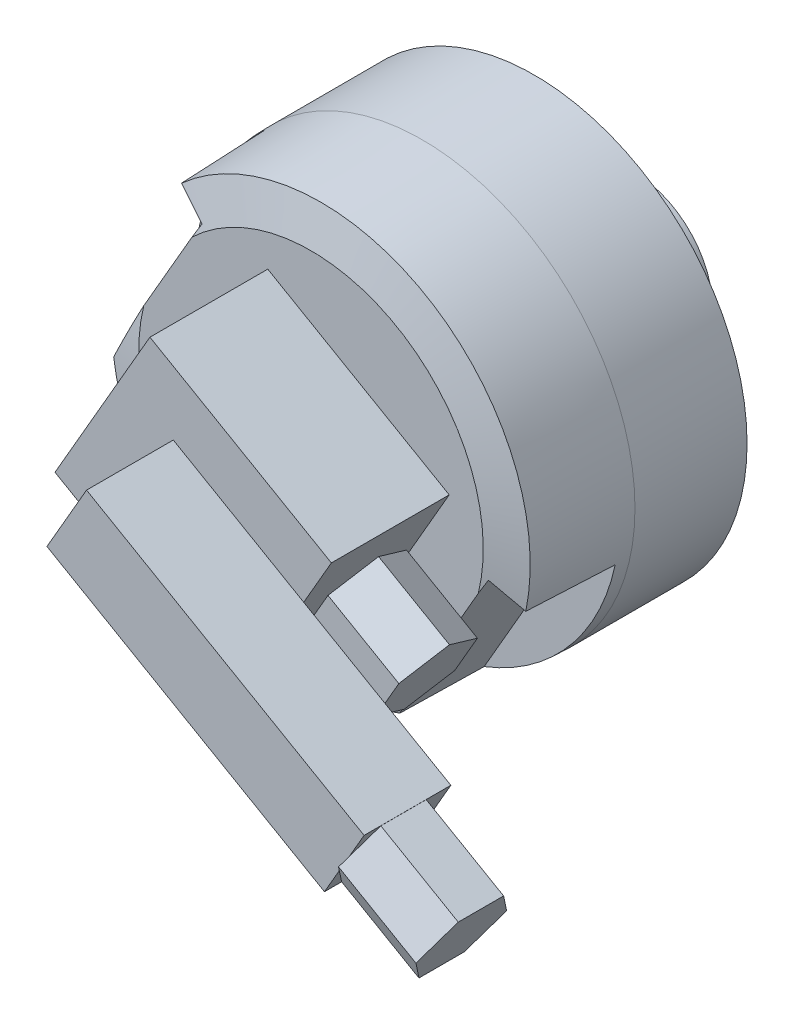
ISO-10303-21;
HEADER;
FILE_DESCRIPTION(('STEP AP214'),'2;1');
FILE_NAME('part.step','',(''),(''),'','','');
FILE_SCHEMA(('AUTOMOTIVE_DESIGN { 1 0 10303 214 1 1 1 1 }'));
ENDSEC;
DATA;
#1=APPLICATION_CONTEXT('core data for automotive mechanical design processes');
#2=APPLICATION_PROTOCOL_DEFINITION('international standard','automotive_design',2000,#1);
#3=PRODUCT_CONTEXT('',#1,'mechanical');
#4=PRODUCT('Part','Part','',(#3));
#5=PRODUCT_RELATED_PRODUCT_CATEGORY('part','',(#4));
#6=PRODUCT_DEFINITION_FORMATION('','',#4);
#7=PRODUCT_DEFINITION_CONTEXT('part definition',#1,'design');
#8=PRODUCT_DEFINITION('design','',#6,#7);
#9=PRODUCT_DEFINITION_SHAPE('','',#8);
#10=(LENGTH_UNIT() NAMED_UNIT(*) SI_UNIT(.MILLI.,.METRE.));
#11=(NAMED_UNIT(*) PLANE_ANGLE_UNIT() SI_UNIT($,.RADIAN.));
#12=(NAMED_UNIT(*) SI_UNIT($,.STERADIAN.) SOLID_ANGLE_UNIT());
#13=UNCERTAINTY_MEASURE_WITH_UNIT(LENGTH_MEASURE(1.E-05),#10,'distance_accuracy_value','');
#14=(GEOMETRIC_REPRESENTATION_CONTEXT(3) GLOBAL_UNCERTAINTY_ASSIGNED_CONTEXT((#13)) GLOBAL_UNIT_ASSIGNED_CONTEXT((#10,
#11,#12)) REPRESENTATION_CONTEXT('',''));
#15=CARTESIAN_POINT('',(0.,0.,0.));
#16=DIRECTION('',(0.,0.,1.));
#17=DIRECTION('',(1.,0.,0.));
#18=AXIS2_PLACEMENT_3D('',#15,#16,#17);
#19=CARTESIAN_POINT('',(13.2128129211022,-41.1147367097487,104.2));
#20=DIRECTION('',(-0.86602540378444,0.499999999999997,0.));
#21=DIRECTION('',(-0.499999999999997,-0.86602540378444,0.));
#22=AXIS2_PLACEMENT_3D('',#19,#20,#21);
#23=PLANE('',#22);
#24=DIRECTION('',(0.499999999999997,0.86602540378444,0.));
#25=VECTOR('',#24,1.);
#26=CARTESIAN_POINT('',(13.2128129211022,-41.1147367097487,68.2));
#27=LINE('',#26,#25);
#28=CARTESIAN_POINT('',(13.2128129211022,-41.1147367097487,68.2));
#29=VERTEX_POINT('',#28);
#30=CARTESIAN_POINT('',(42.212812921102,9.11473670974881,68.2));
#31=VERTEX_POINT('',#30);
#32=EDGE_CURVE('E372',#29,#31,#27,.T.);
#33=ORIENTED_EDGE('',*,*,#32,.T.);
#34=DIRECTION('',(0.,0.,-1.));
#35=VECTOR('',#34,1.);
#36=CARTESIAN_POINT('',(42.212812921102,9.11473670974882,104.2));
#37=LINE('',#36,#35);
#38=CARTESIAN_POINT('',(42.212812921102,9.11473670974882,104.2));
#39=VERTEX_POINT('',#38);
#40=EDGE_CURVE('E379',#39,#31,#37,.T.);
#41=ORIENTED_EDGE('',*,*,#40,.F.);
#42=DIRECTION('',(0.499999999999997,0.86602540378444,0.));
#43=VECTOR('',#42,1.);
#44=CARTESIAN_POINT('',(13.2128129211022,-41.1147367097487,104.2));
#45=LINE('',#44,#43);
#46=CARTESIAN_POINT('',(33.762812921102,-5.52109261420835,104.2));
#47=VERTEX_POINT('',#46);
#48=EDGE_CURVE('E359',#47,#39,#45,.T.);
#49=ORIENTED_EDGE('',*,*,#48,.F.);
#50=CARTESIAN_POINT('',(21.6628129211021,-26.4789073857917,104.2));
#51=VERTEX_POINT('',#50);
#52=EDGE_CURVE('E364',#51,#47,#45,.T.);
#53=ORIENTED_EDGE('',*,*,#52,.F.);
#54=CARTESIAN_POINT('',(13.2128129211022,-41.1147367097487,104.2));
#55=VERTEX_POINT('',#54);
#56=EDGE_CURVE('E360',#55,#51,#45,.T.);
#57=ORIENTED_EDGE('',*,*,#56,.F.);
#58=DIRECTION('',(0.,0.,-1.));
#59=VECTOR('',#58,1.);
#60=CARTESIAN_POINT('',(13.2128129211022,-41.1147367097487,104.2));
#61=LINE('',#60,#59);
#62=EDGE_CURVE('E382',#55,#29,#61,.T.);
#63=ORIENTED_EDGE('',*,*,#62,.T.);
#64=EDGE_LOOP('',(#33,#41,#49,#53,#57,#63));
#65=FACE_BOUND('',#64,.T.);
#66=DIRECTION('',(0.249999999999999,0.43301270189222,0.866025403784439));
#67=VECTOR('',#66,1.);
#68=CARTESIAN_POINT('',(31.1769145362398,-9.99999999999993,70.2));
#69=LINE('',#68,#67);
#70=CARTESIAN_POINT('',(31.1769145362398,-9.99999999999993,70.2));
#71=VERTEX_POINT('',#70);
#72=CARTESIAN_POINT('',(34.6410161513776,-3.99999999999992,82.2));
#73=VERTEX_POINT('',#72);
#74=EDGE_CURVE('E262',#71,#73,#69,.T.);
#75=ORIENTED_EDGE('',*,*,#74,.F.);
#76=DIRECTION('',(0.499999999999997,0.86602540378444,0.));
#77=VECTOR('',#76,1.);
#78=CARTESIAN_POINT('',(24.2487113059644,-21.9999999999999,70.2));
#79=LINE('',#78,#77);
#80=CARTESIAN_POINT('',(24.2487113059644,-21.9999999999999,70.2));
#81=VERTEX_POINT('',#80);
#82=EDGE_CURVE('E259',#81,#71,#79,.T.);
#83=ORIENTED_EDGE('',*,*,#82,.F.);
#84=DIRECTION('',(0.249999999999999,0.43301270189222,-0.866025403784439));
#85=VECTOR('',#84,1.);
#86=CARTESIAN_POINT('',(20.7846096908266,-27.9999999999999,82.2));
#87=LINE('',#86,#85);
#88=CARTESIAN_POINT('',(20.7846096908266,-27.9999999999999,82.2));
#89=VERTEX_POINT('',#88);
#90=EDGE_CURVE('E912',#89,#81,#87,.T.);
#91=ORIENTED_EDGE('',*,*,#90,.F.);
#92=DIRECTION('',(-0.249999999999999,-0.43301270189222,-0.866025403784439));
#93=VECTOR('',#92,1.);
#94=CARTESIAN_POINT('',(24.2487113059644,-21.9999999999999,94.2));
#95=LINE('',#94,#93);
#96=CARTESIAN_POINT('',(24.2487113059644,-21.9999999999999,94.2));
#97=VERTEX_POINT('',#96);
#98=EDGE_CURVE('E927',#97,#89,#95,.T.);
#99=ORIENTED_EDGE('',*,*,#98,.F.);
#100=DIRECTION('',(-0.499999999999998,-0.86602540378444,0.));
#101=VECTOR('',#100,1.);
#102=CARTESIAN_POINT('',(31.1769145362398,-9.99999999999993,94.2));
#103=LINE('',#102,#101);
#104=CARTESIAN_POINT('',(31.1769145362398,-9.99999999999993,94.2));
#105=VERTEX_POINT('',#104);
#106=EDGE_CURVE('E65',#105,#97,#103,.T.);
#107=ORIENTED_EDGE('',*,*,#106,.F.);
#108=DIRECTION('',(-0.249999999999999,-0.43301270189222,0.866025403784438));
#109=VECTOR('',#108,1.);
#110=CARTESIAN_POINT('',(34.6410161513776,-3.99999999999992,82.2));
#111=LINE('',#110,#109);
#112=EDGE_CURVE('E60',#73,#105,#111,.T.);
#113=ORIENTED_EDGE('',*,*,#112,.F.);
#114=EDGE_LOOP('',(#75,#83,#91,#99,#107,#113));
#115=FACE_BOUND('',#114,.T.);
#116=ADVANCED_FACE('F37',(#65,#115),#23,.F.);
#117=CARTESIAN_POINT('',(78.7095313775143,-31.4710926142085,130.7));
#118=DIRECTION('',(-0.866025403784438,0.500000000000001,0.));
#119=DIRECTION('',(-0.500000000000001,-0.866025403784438,0.));
#120=AXIS2_PLACEMENT_3D('',#117,#118,#119);
#121=PLANE('',#120);
#122=DIRECTION('',(-0.43301270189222,-0.75,0.499999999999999));
#123=VECTOR('',#122,1.);
#124=CARTESIAN_POINT('',(78.6595313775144,-31.5576951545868,125.528203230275));
#125=LINE('',#124,#123);
#126=CARTESIAN_POINT('',(78.6595313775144,-31.5576951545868,125.528203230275));
#127=VERTEX_POINT('',#126);
#128=CARTESIAN_POINT('',(74.1806239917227,-39.3153903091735,130.7));
#129=VERTEX_POINT('',#128);
#130=EDGE_CURVE('E265',#127,#129,#125,.T.);
#131=ORIENTED_EDGE('',*,*,#130,.F.);
#132=DIRECTION('',(0.,0.,1.));
#133=VECTOR('',#132,1.);
#134=CARTESIAN_POINT('',(78.6595313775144,-31.5576951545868,111.671796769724));
#135=LINE('',#134,#133);
#136=CARTESIAN_POINT('',(78.6595313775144,-31.5576951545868,111.671796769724));
#137=VERTEX_POINT('',#136);
#138=EDGE_CURVE('E275',#137,#127,#135,.T.);
#139=ORIENTED_EDGE('',*,*,#138,.F.);
#140=DIRECTION('',(0.43301270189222,0.75,0.5));
#141=VECTOR('',#140,1.);
#142=CARTESIAN_POINT('',(72.6595313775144,-41.9500000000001,104.743593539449));
#143=LINE('',#142,#141);
#144=CARTESIAN_POINT('',(72.6595313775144,-41.9500000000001,104.743593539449));
#145=VERTEX_POINT('',#144);
#146=EDGE_CURVE('E294',#145,#137,#143,.T.);
#147=ORIENTED_EDGE('',*,*,#146,.F.);
#148=DIRECTION('',(0.43301270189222,0.75,-0.499999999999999));
#149=VECTOR('',#148,1.);
#150=CARTESIAN_POINT('',(66.6595313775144,-52.3423048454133,111.671796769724));
#151=LINE('',#150,#149);
#152=CARTESIAN_POINT('',(66.6595313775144,-52.3423048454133,111.671796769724));
#153=VERTEX_POINT('',#152);
#154=EDGE_CURVE('E291',#153,#145,#151,.T.);
#155=ORIENTED_EDGE('',*,*,#154,.F.);
#156=DIRECTION('',(0.,0.,-1.));
#157=VECTOR('',#156,1.);
#158=CARTESIAN_POINT('',(66.6595313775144,-52.3423048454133,125.528203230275));
#159=LINE('',#158,#157);
#160=CARTESIAN_POINT('',(66.6595313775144,-52.3423048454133,125.528203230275));
#161=VERTEX_POINT('',#160);
#162=EDGE_CURVE('E288',#161,#153,#159,.T.);
#163=ORIENTED_EDGE('',*,*,#162,.F.);
#164=DIRECTION('',(-0.43301270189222,-0.75,-0.5));
#165=VECTOR('',#164,1.);
#166=CARTESIAN_POINT('',(72.6595313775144,-41.9500000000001,132.456406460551));
#167=LINE('',#166,#165);
#168=CARTESIAN_POINT('',(71.1384387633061,-44.5846096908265,130.7));
#169=VERTEX_POINT('',#168);
#170=EDGE_CURVE('E12',#169,#161,#167,.T.);
#171=ORIENTED_EDGE('',*,*,#170,.F.);
#172=DIRECTION('',(0.500000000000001,0.866025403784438,0.));
#173=VECTOR('',#172,1.);
#174=CARTESIAN_POINT('',(78.7095313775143,-31.4710926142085,130.7));
#175=LINE('',#174,#173);
#176=CARTESIAN_POINT('',(66.6095313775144,-52.4289073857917,130.7));
#177=VERTEX_POINT('',#176);
#178=EDGE_CURVE('E326',#177,#169,#175,.T.);
#179=ORIENTED_EDGE('',*,*,#178,.F.);
#180=DIRECTION('',(0.,0.,-1.));
#181=VECTOR('',#180,1.);
#182=CARTESIAN_POINT('',(66.6095313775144,-52.4289073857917,130.7));
#183=LINE('',#182,#181);
#184=CARTESIAN_POINT('',(66.6095313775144,-52.4289073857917,104.2));
#185=VERTEX_POINT('',#184);
#186=EDGE_CURVE('E343',#177,#185,#183,.T.);
#187=ORIENTED_EDGE('',*,*,#186,.T.);
#188=DIRECTION('',(0.500000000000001,0.866025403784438,0.));
#189=VECTOR('',#188,1.);
#190=CARTESIAN_POINT('',(78.7095313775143,-31.4710926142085,104.2));
#191=LINE('',#190,#189);
#192=CARTESIAN_POINT('',(78.7095313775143,-31.4710926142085,104.2));
#193=VERTEX_POINT('',#192);
#194=EDGE_CURVE('E321',#185,#193,#191,.T.);
#195=ORIENTED_EDGE('',*,*,#194,.T.);
#196=DIRECTION('',(0.,0.,-1.));
#197=VECTOR('',#196,1.);
#198=CARTESIAN_POINT('',(78.7095313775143,-31.4710926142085,130.7));
#199=LINE('',#198,#197);
#200=CARTESIAN_POINT('',(78.7095313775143,-31.4710926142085,130.7));
#201=VERTEX_POINT('',#200);
#202=EDGE_CURVE('E329',#201,#193,#199,.T.);
#203=ORIENTED_EDGE('',*,*,#202,.F.);
#204=EDGE_CURVE('E325',#129,#201,#175,.T.);
#205=ORIENTED_EDGE('',*,*,#204,.F.);
#206=EDGE_LOOP('',(#131,#139,#147,#155,#163,#171,#179,#187,#195,#203,#205));
#207=FACE_BOUND('',#206,.T.);
#208=ADVANCED_FACE('F546',(#207),#121,.F.);
#209=CARTESIAN_POINT('',(0.,0.,104.2));
#210=DIRECTION('',(0.,0.,-1.));
#211=DIRECTION('',(-1.,0.,0.));
#212=AXIS2_PLACEMENT_3D('',#209,#210,#211);
#213=PLANE('',#212);
#214=DIRECTION('',(-0.866025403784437,0.500000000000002,0.));
#215=VECTOR('',#214,1.);
#216=CARTESIAN_POINT('',(-6.07435565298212,17.4789073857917,104.2));
#217=LINE('',#216,#215);
#218=CARTESIAN_POINT('',(-6.07435565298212,17.4789073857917,104.2));
#219=VERTEX_POINT('',#218);
#220=EDGE_CURVE('E51',#47,#219,#217,.T.);
#221=ORIENTED_EDGE('',*,*,#220,.F.);
#222=ORIENTED_EDGE('',*,*,#48,.T.);
#223=DIRECTION('',(-0.86602540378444,0.499999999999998,0.));
#224=VECTOR('',#223,1.);
#225=CARTESIAN_POINT('',(-13.2128129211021,41.1147367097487,104.2));
#226=LINE('',#225,#224);
#227=CARTESIAN_POINT('',(-13.2128129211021,41.1147367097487,104.2));
#228=VERTEX_POINT('',#227);
#229=EDGE_CURVE('E363',#39,#228,#226,.T.);
#230=ORIENTED_EDGE('',*,*,#229,.T.);
#231=DIRECTION('',(-0.499999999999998,-0.86602540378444,0.));
#232=VECTOR('',#231,1.);
#233=CARTESIAN_POINT('',(-42.212812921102,-9.11473670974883,104.2));
#234=LINE('',#233,#232);
#235=CARTESIAN_POINT('',(-42.212812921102,-9.11473670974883,104.2));
#236=VERTEX_POINT('',#235);
#237=EDGE_CURVE('E353',#228,#236,#234,.T.);
#238=ORIENTED_EDGE('',*,*,#237,.T.);
#239=DIRECTION('',(0.86602540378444,-0.499999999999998,0.));
#240=VECTOR('',#239,1.);
#241=CARTESIAN_POINT('',(-42.212812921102,-9.11473670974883,104.2));
#242=LINE('',#241,#240);
#243=EDGE_CURVE('E356',#236,#55,#242,.T.);
#244=ORIENTED_EDGE('',*,*,#243,.T.);
#245=ORIENTED_EDGE('',*,*,#56,.T.);
#246=DIRECTION('',(0.866025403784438,-0.5,0.));
#247=VECTOR('',#246,1.);
#248=CARTESIAN_POINT('',(-18.1743556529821,-3.47890738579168,104.2));
#249=LINE('',#248,#247);
#250=CARTESIAN_POINT('',(-18.1743556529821,-3.47890738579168,104.2));
#251=VERTEX_POINT('',#250);
#252=EDGE_CURVE('E337',#251,#51,#249,.T.);
#253=ORIENTED_EDGE('',*,*,#252,.F.);
#254=DIRECTION('',(-0.500000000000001,-0.866025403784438,0.));
#255=VECTOR('',#254,1.);
#256=CARTESIAN_POINT('',(-6.07435565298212,17.4789073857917,104.2));
#257=LINE('',#256,#255);
#258=EDGE_CURVE('E333',#219,#251,#257,.T.);
#259=ORIENTED_EDGE('',*,*,#258,.F.);
#260=EDGE_LOOP('',(#221,#222,#230,#238,#244,#245,#253,#259));
#261=FACE_BOUND('',#260,.T.);
#262=ADVANCED_FACE('F552',(#261),#213,.F.);
#263=CARTESIAN_POINT('',(-52.61,0.,68.2));
#264=DIRECTION('',(0.,0.,-1.));
#265=DIRECTION('',(-1.,0.,0.));
#266=AXIS2_PLACEMENT_3D('',#263,#264,#265);
#267=PLANE('',#266);
#268=CARTESIAN_POINT('',(0.,0.,68.2));
#269=DIRECTION('',(0.,0.,1.));
#270=DIRECTION('',(1.,0.,0.));
#271=AXIS2_PLACEMENT_3D('',#268,#269,#270);
#272=CIRCLE('',#271,52.61);
#273=CARTESIAN_POINT('',(-51.10927611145,12.4761370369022,68.2));
#274=VERTEX_POINT('',#273);
#275=CARTESIAN_POINT('',(36.3592896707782,-38.0238629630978,68.2));
#276=VERTEX_POINT('',#275);
#277=EDGE_CURVE('E492',#274,#276,#272,.T.);
#278=ORIENTED_EDGE('',*,*,#277,.T.);
#279=DIRECTION('',(-0.500000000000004,-0.866025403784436,0.));
#280=VECTOR('',#279,1.);
#281=CARTESIAN_POINT('',(53.7342828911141,-7.92949192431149,68.2));
#282=LINE('',#281,#280);
#283=CARTESIAN_POINT('',(51.1092761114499,-12.4761370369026,68.2));
#284=VERTEX_POINT('',#283);
#285=EDGE_CURVE('E388',#284,#276,#282,.T.);
#286=ORIENTED_EDGE('',*,*,#285,.F.);
#287=CARTESIAN_POINT('',(-36.3592896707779,38.0238629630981,68.2));
#288=VERTEX_POINT('',#287);
#289=EDGE_CURVE('E491',#284,#288,#272,.T.);
#290=ORIENTED_EDGE('',*,*,#289,.T.);
#291=DIRECTION('',(0.500000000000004,0.866025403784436,0.));
#292=VECTOR('',#291,1.);
#293=CARTESIAN_POINT('',(-33.7342828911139,42.5705080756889,68.2));
#294=LINE('',#293,#292);
#295=EDGE_CURVE('E522',#274,#288,#294,.T.);
#296=ORIENTED_EDGE('',*,*,#295,.F.);
#297=EDGE_LOOP('',(#278,#286,#290,#296));
#298=FACE_BOUND('',#297,.T.);
#299=DIRECTION('',(-0.499999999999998,-0.86602540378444,0.));
#300=VECTOR('',#299,1.);
#301=CARTESIAN_POINT('',(-42.212812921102,-9.11473670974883,68.2));
#302=LINE('',#301,#300);
#303=CARTESIAN_POINT('',(-13.2128129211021,41.1147367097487,68.2));
#304=VERTEX_POINT('',#303);
#305=CARTESIAN_POINT('',(-42.212812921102,-9.11473670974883,68.2));
#306=VERTEX_POINT('',#305);
#307=EDGE_CURVE('E352',#304,#306,#302,.T.);
#308=ORIENTED_EDGE('',*,*,#307,.F.);
#309=DIRECTION('',(-0.86602540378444,0.499999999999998,0.));
#310=VECTOR('',#309,1.);
#311=CARTESIAN_POINT('',(-13.2128129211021,41.1147367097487,68.2));
#312=LINE('',#311,#310);
#313=EDGE_CURVE('E357',#31,#304,#312,.T.);
#314=ORIENTED_EDGE('',*,*,#313,.F.);
#315=ORIENTED_EDGE('',*,*,#32,.F.);
#316=DIRECTION('',(0.86602540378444,-0.499999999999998,0.));
#317=VECTOR('',#316,1.);
#318=CARTESIAN_POINT('',(-42.212812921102,-9.11473670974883,68.2));
#319=LINE('',#318,#317);
#320=EDGE_CURVE('E369',#306,#29,#319,.T.);
#321=ORIENTED_EDGE('',*,*,#320,.F.);
#322=EDGE_LOOP('',(#308,#314,#315,#321));
#323=FACE_BOUND('',#322,.T.);
#324=ADVANCED_FACE('F656',(#298,#323),#267,.F.);
#325=CARTESIAN_POINT('',(0.,0.,65.1695167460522));
#326=DIRECTION('',(0.,0.,-1.));
#327=DIRECTION('',(-1.,0.,0.));
#328=AXIS2_PLACEMENT_3D('',#325,#326,#327);
#329=CONICAL_SURFACE('',#328,63.9199174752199,1.30899693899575);
#330=CARTESIAN_POINT('',(0.,0.,65.1695167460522));
#331=DIRECTION('',(0.,0.,1.));
#332=DIRECTION('',(1.,0.,0.));
#333=AXIS2_PLACEMENT_3D('',#330,#331,#332);
#334=CIRCLE('',#333,63.9199174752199);
#335=CARTESIAN_POINT('',(-63.327048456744,-8.68566542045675,65.1695167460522));
#336=VERTEX_POINT('',#335);
#337=CARTESIAN_POINT('',(24.141517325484,-59.185665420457,65.1695167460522));
#338=VERTEX_POINT('',#337);
#339=EDGE_CURVE('E488',#336,#338,#334,.T.);
#340=ORIENTED_EDGE('',*,*,#339,.T.);
#341=CARTESIAN_POINT('',(-4.61678083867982,-108.996498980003,53.0650956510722));
#342=CARTESIAN_POINT('',(-4.0449401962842,-108.006041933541,53.3367318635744));
#343=CARTESIAN_POINT('',(-3.47298413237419,-107.015384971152,53.6073957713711));
#344=CARTESIAN_POINT('',(-2.32882019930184,-105.033634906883,54.1465913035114));
#345=CARTESIAN_POINT('',(-1.75661232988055,-104.042541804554,54.4151229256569));
#346=CARTESIAN_POINT('',(-0.0395678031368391,-101.068533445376,55.217243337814));
#347=CARTESIAN_POINT('',(1.10567625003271,-99.0849125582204,55.7473512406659));
#348=CARTESIAN_POINT('',(3.39756333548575,-95.1152476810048,56.7964983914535));
#349=CARTESIAN_POINT('',(4.5442065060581,-93.1292034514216,57.3155364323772));
#350=CARTESIAN_POINT('',(6.83899422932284,-89.1545145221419,58.3401587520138));
#351=CARTESIAN_POINT('',(7.98713877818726,-87.1658698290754,58.845743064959));
#352=CARTESIAN_POINT('',(10.2985292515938,-83.1624240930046,59.8462948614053));
#353=CARTESIAN_POINT('',(11.4617959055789,-81.1475871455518,60.3410712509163));
#354=CARTESIAN_POINT('',(13.7904833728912,-77.1141821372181,61.3100040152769));
#355=CARTESIAN_POINT('',(14.9559041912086,-75.0956140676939,61.7841603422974));
#356=CARTESIAN_POINT('',(17.2894463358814,-71.0538005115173,62.7070152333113));
#357=CARTESIAN_POINT('',(18.457568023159,-69.0305543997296,63.1557101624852));
#358=CARTESIAN_POINT('',(20.79676109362,-64.9789531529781,64.0213626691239));
#359=CARTESIAN_POINT('',(21.9678324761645,-62.9505980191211,64.4383202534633));
#360=CARTESIAN_POINT('',(24.2774453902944,-58.9502311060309,65.2206017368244));
#361=CARTESIAN_POINT('',(25.4158851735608,-56.9783955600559,65.5871156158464));
#362=CARTESIAN_POINT('',(27.1261188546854,-54.0161839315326,66.1026360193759));
#363=CARTESIAN_POINT('',(27.6966246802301,-53.0280388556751,66.2687674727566));
#364=CARTESIAN_POINT('',(28.8385410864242,-51.0501816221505,66.5884155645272));
#365=CARTESIAN_POINT('',(29.4099517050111,-50.0604693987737,66.7419316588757));
#366=CARTESIAN_POINT('',(31.1252443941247,-47.0894953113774,67.1816007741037));
#367=CARTESIAN_POINT('',(32.2704998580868,-45.1058546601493,67.446970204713));
#368=CARTESIAN_POINT('',(33.9908384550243,-42.1261408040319,67.7956759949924));
#369=CARTESIAN_POINT('',(34.5646897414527,-41.1322012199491,67.9036859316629));
#370=CARTESIAN_POINT('',(35.713152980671,-39.1430045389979,68.1020172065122));
#371=CARTESIAN_POINT('',(36.2877649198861,-38.1477474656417,68.1923388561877));
#372=CARTESIAN_POINT('',(37.4347518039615,-36.1611079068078,68.3537449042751));
#373=CARTESIAN_POINT('',(38.0071234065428,-35.1697312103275,68.4249240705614));
#374=CARTESIAN_POINT('',(39.1523846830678,-33.186080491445,68.5476810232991));
#375=CARTESIAN_POINT('',(39.7252743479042,-32.1938064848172,68.5992591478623));
#376=CARTESIAN_POINT('',(40.8714247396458,-30.2086157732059,68.6820764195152));
#377=CARTESIAN_POINT('',(41.4446854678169,-29.2156990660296,68.7133154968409));
#378=CARTESIAN_POINT('',(42.5913987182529,-27.229533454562,68.7549880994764));
#379=CARTESIAN_POINT('',(43.1648512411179,-26.2362845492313,68.7654215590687));
#380=CARTESIAN_POINT('',(44.3117373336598,-24.2498195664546,68.7653236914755));
#381=CARTESIAN_POINT('',(44.8851709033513,-23.2566034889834,68.7547930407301));
#382=CARTESIAN_POINT('',(46.0318484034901,-21.2704997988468,68.7129287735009));
#383=CARTESIAN_POINT('',(46.6050923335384,-20.2776121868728,68.6815951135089));
#384=CARTESIAN_POINT('',(47.7512003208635,-18.2924949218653,68.5985931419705));
#385=CARTESIAN_POINT('',(48.3240643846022,-17.3002652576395,68.5469251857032));
#386=CARTESIAN_POINT('',(49.4692581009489,-15.3167315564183,68.4239959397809));
#387=CARTESIAN_POINT('',(50.0415877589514,-14.3254275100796,68.3527348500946));
#388=CARTESIAN_POINT('',(51.2224668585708,-12.2800849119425,68.1863850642));
#389=CARTESIAN_POINT('',(51.8309725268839,-11.2261221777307,68.0900563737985));
#390=CARTESIAN_POINT('',(53.0470925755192,-9.1197404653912,67.8776503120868));
#391=CARTESIAN_POINT('',(53.6547069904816,-8.06732142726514,67.7615737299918));
#392=CARTESIAN_POINT('',(54.8689421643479,-5.96420441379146,67.5111666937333));
#393=CARTESIAN_POINT('',(55.4755629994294,-4.91350630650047,67.3768377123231));
#394=CARTESIAN_POINT('',(56.6878208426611,-2.8138141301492,67.0914496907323));
#395=CARTESIAN_POINT('',(57.2934578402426,-1.76482007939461,66.9403904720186));
#396=CARTESIAN_POINT('',(59.1119597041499,1.38491754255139,66.463619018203));
#397=CARTESIAN_POINT('',(60.3233283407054,3.48306956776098,66.1149650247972));
#398=CARTESIAN_POINT('',(62.7422017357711,7.67268118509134,65.3681341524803));
#399=CARTESIAN_POINT('',(63.9497064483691,9.76414069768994,64.9699566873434));
#400=CARTESIAN_POINT('',(66.3809185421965,13.9751235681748,64.1270901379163));
#401=CARTESIAN_POINT('',(67.6045690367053,16.0945483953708,63.6817484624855));
#402=CARTESIAN_POINT('',(70.048787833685,20.3280595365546,62.7584474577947));
#403=CARTESIAN_POINT('',(71.2693561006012,22.4421457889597,62.2804877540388));
#404=CARTESIAN_POINT('',(73.0956827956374,25.6054364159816,61.5450492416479));
#405=CARTESIAN_POINT('',(73.7024336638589,26.6563597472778,61.2973597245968));
#406=CARTESIAN_POINT('',(74.9153378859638,28.7571714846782,60.7961830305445));
#407=CARTESIAN_POINT('',(75.5214912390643,29.8070598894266,60.5426958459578));
#408=CARTESIAN_POINT('',(76.7332053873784,31.9058103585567,60.0305509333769));
#409=CARTESIAN_POINT('',(77.3387662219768,32.9546724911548,59.7718935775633));
#410=CARTESIAN_POINT('',(78.5493808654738,35.0515185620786,59.2499064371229));
#411=CARTESIAN_POINT('',(79.154434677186,36.0995025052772,58.9865766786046));
#412=CARTESIAN_POINT('',(79.759259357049,37.1470895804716,58.7211671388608));
#413=B_SPLINE_CURVE_WITH_KNOTS('',3,(#341,#342,#343,#344,#345,#346,#347,#348,#349,#350,#351,
#352,#353,#354,#355,#356,#357,#358,#359,#360,#361,#362,#363,#364,#365,#366,#367,#368,#369,#370,
#371,#372,#373,#374,#375,#376,#377,#378,#379,#380,#381,#382,#383,#384,#385,#386,#387,#388,#389,
#390,#391,#392,#393,#394,#395,#396,#397,#398,#399,#400,#401,#402,#403,#404,#405,#406,#407,#408,
#409,#410,#411,#412),.UNSPECIFIED.,.F.,.F.,(4,2,2,2,2,2,2,2,2,2,2,2,2,2,2,2,2,2,2,2,2,2,2,2,2,2,
2,2,2,2,2,2,2,2,2,4),(0.,3.52649009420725,7.05298382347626,14.1060546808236,21.1598906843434,
28.2137087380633,35.3493218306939,42.4849514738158,49.6215972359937,56.7582414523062,
63.6763918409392,67.1354540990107,70.5946654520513,77.5111914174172,80.9694045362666,
84.4275567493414,87.8682597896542,91.3089034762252,94.7495589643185,98.1902253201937,
101.630780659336,105.071343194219,108.511845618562,111.952312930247,115.614591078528,
119.276722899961,122.938559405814,126.6004349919,133.942805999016,141.285263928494,
148.747457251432,156.209736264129,159.925291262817,163.640851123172,167.356144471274,
171.071417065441),.UNSPECIFIED.);
#414=EDGE_CURVE('E397',#338,#276,#413,.T.);
#415=ORIENTED_EDGE('',*,*,#414,.T.);
#416=ORIENTED_EDGE('',*,*,#277,.F.);
#417=CARTESIAN_POINT('',(-1.94670505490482,97.6282079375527,56.1322075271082));
#418=CARTESIAN_POINT('',(-2.45909574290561,96.7407212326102,56.36722190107));
#419=CARTESIAN_POINT('',(-2.97161170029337,95.8530175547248,56.6011432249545));
#420=CARTESIAN_POINT('',(-3.99691560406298,94.0771391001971,57.0665962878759));
#421=CARTESIAN_POINT('',(-4.50970355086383,93.1889643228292,57.2981280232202));
#422=CARTESIAN_POINT('',(-6.04852275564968,90.5236512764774,57.9888404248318));
#423=CARTESIAN_POINT('',(-7.07499181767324,88.745754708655,58.4441302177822));
#424=CARTESIAN_POINT('',(-9.1295336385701,85.1871838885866,59.3424688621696));
#425=CARTESIAN_POINT('',(-10.157606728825,83.4065090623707,59.7855146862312));
#426=CARTESIAN_POINT('',(-12.2153199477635,79.8424452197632,60.6567969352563));
#427=CARTESIAN_POINT('',(-13.2449600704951,78.0590562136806,61.0850334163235));
#428=CARTESIAN_POINT('',(-15.3134922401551,74.476253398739,61.9266939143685));
#429=CARTESIAN_POINT('',(-16.3523974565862,72.6768167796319,62.3399888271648));
#430=CARTESIAN_POINT('',(-18.4323381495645,69.0742538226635,63.1446585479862));
#431=CARTESIAN_POINT('',(-19.473373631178,67.271127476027,63.5360333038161));
#432=CARTESIAN_POINT('',(-21.5579558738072,63.6605251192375,64.2921904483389));
#433=CARTESIAN_POINT('',(-22.601502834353,61.8530487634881,64.6569706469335));
#434=CARTESIAN_POINT('',(-24.6913089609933,58.2333983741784,65.3542058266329));
#435=CARTESIAN_POINT('',(-25.7375681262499,56.4212243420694,65.686660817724));
#436=CARTESIAN_POINT('',(-27.8105081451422,52.8307869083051,66.305786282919));
#437=CARTESIAN_POINT('',(-28.83712652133,51.052631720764,66.5932871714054));
#438=CARTESIAN_POINT('',(-30.8932559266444,47.4913111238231,67.12375736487));
#439=CARTESIAN_POINT('',(-31.9227669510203,45.7081457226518,67.3667267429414));
#440=CARTESIAN_POINT('',(-33.9843040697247,42.1374586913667,67.8005119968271));
#441=CARTESIAN_POINT('',(-35.0163294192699,40.3499383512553,67.991341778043));
#442=CARTESIAN_POINT('',(-36.5660849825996,37.6656829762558,68.2331650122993));
#443=CARTESIAN_POINT('',(-37.0829627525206,36.7704244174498,68.3063698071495));
#444=CARTESIAN_POINT('',(-38.1172082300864,34.9790587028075,68.4372104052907));
#445=CARTESIAN_POINT('',(-38.6345759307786,34.0829515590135,68.4948464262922));
#446=CARTESIAN_POINT('',(-39.6676843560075,32.2935552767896,68.5937019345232));
#447=CARTESIAN_POINT('',(-40.183423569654,31.4002687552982,68.6349844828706));
#448=CARTESIAN_POINT('',(-41.2151681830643,29.6132346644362,68.7009675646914));
#449=CARTESIAN_POINT('',(-41.731173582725,28.719487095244,68.7256681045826));
#450=CARTESIAN_POINT('',(-42.7633151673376,26.9317654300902,68.758186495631));
#451=CARTESIAN_POINT('',(-43.2794513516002,26.0377913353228,68.7660044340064));
#452=CARTESIAN_POINT('',(-44.3117183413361,24.2498524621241,68.7646614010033));
#453=CARTESIAN_POINT('',(-44.8278491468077,23.3558876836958,68.7555004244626));
#454=CARTESIAN_POINT('',(-45.8600184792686,21.5681179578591,68.7203108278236));
#455=CARTESIAN_POINT('',(-46.3760569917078,20.6743130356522,68.6942805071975));
#456=CARTESIAN_POINT('',(-47.4078572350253,18.8871825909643,68.6256665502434));
#457=CARTESIAN_POINT('',(-47.9236189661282,17.9938570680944,68.583082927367));
#458=CARTESIAN_POINT('',(-48.9547525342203,16.2078813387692,68.481861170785));
#459=CARTESIAN_POINT('',(-49.4701243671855,15.3152311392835,68.4232228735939));
#460=CARTESIAN_POINT('',(-50.5003732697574,13.530787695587,68.2905471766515));
#461=CARTESIAN_POINT('',(-51.0152503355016,12.638994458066,68.2165096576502));
#462=CARTESIAN_POINT('',(-52.1964992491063,10.5930113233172,68.0297678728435));
#463=CARTESIAN_POINT('',(-52.8626759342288,9.4391594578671,67.9121026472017));
#464=CARTESIAN_POINT('',(-54.1939258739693,7.13336692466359,67.6541107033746));
#465=CARTESIAN_POINT('',(-54.8589991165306,5.98142627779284,67.5137837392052));
#466=CARTESIAN_POINT('',(-56.8525145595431,2.5285562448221,67.0618313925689));
#467=CARTESIAN_POINT('',(-58.1792224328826,0.230630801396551,66.7192394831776));
#468=CARTESIAN_POINT('',(-60.1658871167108,-3.21037336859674,66.1552775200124));
#469=CARTESIAN_POINT('',(-60.8276762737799,-4.35662581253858,65.9588996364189));
#470=CARTESIAN_POINT('',(-62.150109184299,-6.64714680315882,65.5512686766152));
#471=CARTESIAN_POINT('',(-62.8107529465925,-7.79141536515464,65.3400157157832));
#472=CARTESIAN_POINT('',(-64.130933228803,-10.0780346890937,64.9043209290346));
#473=CARTESIAN_POINT('',(-64.7904697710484,-11.2203854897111,64.6798793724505));
#474=CARTESIAN_POINT('',(-66.1085206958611,-13.5033166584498,64.219314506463));
#475=CARTESIAN_POINT('',(-66.7670350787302,-14.6438970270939,63.98319120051));
#476=CARTESIAN_POINT('',(-68.0871637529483,-16.9304269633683,63.4991280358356));
#477=CARTESIAN_POINT('',(-68.748772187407,-18.0763663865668,63.2511244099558));
#478=CARTESIAN_POINT('',(-70.0711072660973,-20.3667179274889,62.7458713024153));
#479=CARTESIAN_POINT('',(-70.7318339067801,-21.5111300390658,62.4886217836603));
#480=CARTESIAN_POINT('',(-72.0524740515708,-23.7985458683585,61.9659480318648));
#481=CARTESIAN_POINT('',(-72.7123875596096,-24.9415495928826,61.7005238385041));
#482=CARTESIAN_POINT('',(-74.0314761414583,-27.2262780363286,61.1624281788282));
#483=CARTESIAN_POINT('',(-74.690651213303,-28.3680027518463,60.8897566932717));
#484=CARTESIAN_POINT('',(-76.6668351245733,-31.7908536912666,60.0622660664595));
#485=CARTESIAN_POINT('',(-77.9828388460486,-34.0702389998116,59.4978367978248));
#486=CARTESIAN_POINT('',(-80.6126198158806,-38.6251532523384,58.3487099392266));
#487=CARTESIAN_POINT('',(-81.9263970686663,-40.9006822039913,57.7640123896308));
#488=CARTESIAN_POINT('',(-84.5964516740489,-45.5253524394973,56.5583652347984));
#489=CARTESIAN_POINT('',(-85.9526660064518,-47.8743845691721,55.9368581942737));
#490=CARTESIAN_POINT('',(-88.663477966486,-52.5696486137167,54.67992129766));
#491=CARTESIAN_POINT('',(-90.0180755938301,-54.915880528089,54.0444914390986));
#492=CARTESIAN_POINT('',(-92.7260226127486,-59.6061823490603,52.7622848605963));
#493=CARTESIAN_POINT('',(-94.0793719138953,-61.9502520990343,52.1155073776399));
#494=CARTESIAN_POINT('',(-96.7849525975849,-66.6364553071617,50.8126799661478));
#495=CARTESIAN_POINT('',(-98.1371839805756,-68.9785887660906,50.1566300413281));
#496=CARTESIAN_POINT('',(-100.826590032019,-73.6367766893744,48.8437409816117));
#497=CARTESIAN_POINT('',(-102.16377444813,-75.9528480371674,48.1869816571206));
#498=CARTESIAN_POINT('',(-104.837365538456,-80.5836436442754,46.867159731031));
#499=CARTESIAN_POINT('',(-106.173772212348,-82.89836790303,46.2040971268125));
#500=CARTESIAN_POINT('',(-108.845786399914,-87.52643223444,44.8727236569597));
#501=CARTESIAN_POINT('',(-110.181393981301,-89.8397724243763,44.2044133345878));
#502=CARTESIAN_POINT('',(-112.852034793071,-94.4654579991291,42.8632388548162));
#503=CARTESIAN_POINT('',(-114.187068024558,-96.7778033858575,42.1903747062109));
#504=CARTESIAN_POINT('',(-115.521860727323,-99.0897321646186,41.5156130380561));
#505=B_SPLINE_CURVE_WITH_KNOTS('',3,(#417,#418,#419,#420,#421,#422,#423,#424,#425,#426,#427,
#428,#429,#430,#431,#432,#433,#434,#435,#436,#437,#438,#439,#440,#441,#442,#443,#444,#445,#446,
#447,#448,#449,#450,#451,#452,#453,#454,#455,#456,#457,#458,#459,#460,#461,#462,#463,#464,#465,
#466,#467,#468,#469,#470,#471,#472,#473,#474,#475,#476,#477,#478,#479,#480,#481,#482,#483,#484,
#485,#486,#487,#488,#489,#490,#491,#492,#493,#494,#495,#496,#497,#498,#499,#500,#501,#502,#503,
#504),.UNSPECIFIED.,.F.,.F.,(4,2,2,2,2,2,2,2,2,2,2,2,2,2,2,2,2,2,2,2,2,2,2,2,2,2,2,2,2,2,2,2,2,
2,2,2,2,2,2,2,2,2,2,4),(0.,3.1541513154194,6.30830750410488,12.6167279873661,18.9266945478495,
25.2366372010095,31.5920880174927,37.9475539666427,44.3035427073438,50.6595294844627,
56.8789181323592,63.0982965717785,69.3160147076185,72.4249497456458,75.5338413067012,
78.6306250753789,81.7274076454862,84.8241742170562,87.9209417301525,91.0180214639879,
94.1150986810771,97.2122074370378,100.30934017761,104.32172989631,108.334163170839,
116.35921049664,120.373361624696,124.387481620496,128.401519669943,132.415556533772,
136.454291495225,140.493042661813,144.531774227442,148.570516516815,156.645944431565,
164.721356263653,173.069474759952,181.417594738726,189.766278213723,198.114958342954,
206.376440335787,214.637925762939,222.898566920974,231.159192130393),.UNSPECIFIED.);
#506=EDGE_CURVE('E474',#274,#336,#505,.T.);
#507=ORIENTED_EDGE('',*,*,#506,.T.);
#508=EDGE_LOOP('',(#340,#415,#416,#507));
#509=FACE_BOUND('',#508,.T.);
#510=ADVANCED_FACE('F513',(#509),#329,.T.);
#511=CARTESIAN_POINT('',(0.,0.,24.8990320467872));
#512=DIRECTION('',(0.,0.,1.));
#513=DIRECTION('',(1.,0.,0.));
#514=AXIS2_PLACEMENT_3D('',#511,#512,#513);
#515=CYLINDRICAL_SURFACE('',#514,24.);
#516=CARTESIAN_POINT('',(0.,0.,0.));
#517=DIRECTION('',(0.,0.,1.));
#518=DIRECTION('',(1.,0.,0.));
#519=AXIS2_PLACEMENT_3D('',#516,#517,#518);
#520=CIRCLE('',#519,24.);
#521=CARTESIAN_POINT('',(24.,0.,0.));
#522=VERTEX_POINT('',#521);
#523=EDGE_CURVE('E472',#522,#522,#520,.T.);
#524=ORIENTED_EDGE('',*,*,#523,.F.);
#525=EDGE_LOOP('',(#524));
#526=FACE_BOUND('',#525,.T.);
#527=CARTESIAN_POINT('',(0.,0.,-30.5));
#528=DIRECTION('',(0.,0.,1.));
#529=DIRECTION('',(1.,0.,0.));
#530=AXIS2_PLACEMENT_3D('',#527,#528,#529);
#531=CIRCLE('',#530,24.);
#532=CARTESIAN_POINT('',(24.,0.,-30.5));
#533=VERTEX_POINT('',#532);
#534=EDGE_CURVE('E495',#533,#533,#531,.T.);
#535=ORIENTED_EDGE('',*,*,#534,.T.);
#536=EDGE_LOOP('',(#535));
#537=FACE_BOUND('',#536,.T.);
#538=ADVANCED_FACE('F39',(#526,#537),#515,.T.);
#539=CARTESIAN_POINT('',(-24.,0.,-30.5));
#540=DIRECTION('',(0.,0.,1.));
#541=DIRECTION('',(1.,0.,0.));
#542=AXIS2_PLACEMENT_3D('',#539,#540,#541);
#543=PLANE('',#542);
#544=ORIENTED_EDGE('',*,*,#534,.F.);
#545=EDGE_LOOP('',(#544));
#546=FACE_BOUND('',#545,.T.);
#547=ADVANCED_FACE('F664',(#546),#543,.F.);
#548=CARTESIAN_POINT('',(53.7342828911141,-7.92949192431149,67.7428240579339));
#549=VERTEX_POINT('',#548);
#550=EDGE_CURVE('E405',#284,#549,#413,.T.);
#551=ORIENTED_EDGE('',*,*,#550,.T.);
#552=CARTESIAN_POINT('',(53.7340828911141,-7.92937645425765,67.7428815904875));
#553=CARTESIAN_POINT('',(54.4715357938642,-8.35514508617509,67.5307392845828));
#554=CARTESIAN_POINT('',(55.2088426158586,-8.78082937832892,67.3179208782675));
#555=CARTESIAN_POINT('',(56.6831935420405,-9.63204628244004,66.8910796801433));
#556=CARTESIAN_POINT('',(57.4202376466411,-10.0575788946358,66.6770568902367));
#557=CARTESIAN_POINT('',(58.8940946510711,-10.9085106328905,66.2479541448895));
#558=CARTESIAN_POINT('',(59.630907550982,-11.3339097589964,66.0328741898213));
#559=CARTESIAN_POINT('',(61.1043279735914,-12.1845894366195,65.6017726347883));
#560=CARTESIAN_POINT('',(61.8409354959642,-12.6098699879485,65.3857510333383));
#561=CARTESIAN_POINT('',(62.5774519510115,-13.0350979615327,65.1693167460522));
#562=B_SPLINE_CURVE_WITH_KNOTS('',3,(#552,#553,#554,#555,#556,#557,#558,#559,#560,#561),
.UNSPECIFIED.,.F.,.F.,(4,2,2,2,4),(0.,2.63269393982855,5.2653837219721,7.89807257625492,
10.5307655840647),.UNSPECIFIED.);
#563=CARTESIAN_POINT('',(62.5767713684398,-13.0347050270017,65.1695167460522));
#564=VERTEX_POINT('',#563);
#565=EDGE_CURVE('E406',#549,#564,#562,.T.);
#566=ORIENTED_EDGE('',*,*,#565,.T.);
#567=CARTESIAN_POINT('',(-42.5767713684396,47.6757211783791,65.1695167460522));
#568=VERTEX_POINT('',#567);
#569=EDGE_CURVE('E487',#564,#568,#334,.T.);
#570=ORIENTED_EDGE('',*,*,#569,.T.);
#571=CARTESIAN_POINT('',(-42.5774519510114,47.6761141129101,65.1693167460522));
#572=CARTESIAN_POINT('',(-41.840935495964,47.2508861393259,65.3857510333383));
#573=CARTESIAN_POINT('',(-41.1043279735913,46.8256055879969,65.6017726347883));
#574=CARTESIAN_POINT('',(-39.6309075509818,45.9749259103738,66.0328741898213));
#575=CARTESIAN_POINT('',(-38.8940946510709,45.5495267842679,66.2479541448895));
#576=CARTESIAN_POINT('',(-37.4202376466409,44.6985950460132,66.6770568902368));
#577=CARTESIAN_POINT('',(-36.6831935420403,44.2730624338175,66.8910796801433));
#578=CARTESIAN_POINT('',(-35.2088426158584,43.4218455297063,67.3179208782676));
#579=CARTESIAN_POINT('',(-34.471535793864,42.9961612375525,67.5307392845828));
#580=CARTESIAN_POINT('',(-33.7340828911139,42.570392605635,67.7428815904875));
#581=B_SPLINE_CURVE_WITH_KNOTS('',3,(#571,#572,#573,#574,#575,#576,#577,#578,#579,#580),
.UNSPECIFIED.,.F.,.F.,(4,2,2,2,4),(0.,2.63269300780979,5.26538186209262,7.8980716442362,
10.5307655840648),.UNSPECIFIED.);
#582=CARTESIAN_POINT('',(-33.7342828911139,42.5705080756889,67.742824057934));
#583=VERTEX_POINT('',#582);
#584=EDGE_CURVE('E465',#568,#583,#581,.T.);
#585=ORIENTED_EDGE('',*,*,#584,.T.);
#586=EDGE_CURVE('E473',#583,#288,#505,.T.);
#587=ORIENTED_EDGE('',*,*,#586,.T.);
#588=ORIENTED_EDGE('',*,*,#289,.F.);
#589=EDGE_LOOP('',(#551,#566,#570,#585,#587,#588));
#590=FACE_BOUND('',#589,.T.);
#591=ADVANCED_FACE('F411',(#590),#329,.T.);
#592=CARTESIAN_POINT('',(0.,0.,34.24));
#593=DIRECTION('',(0.,0.,-1.));
#594=DIRECTION('',(-1.,0.,0.));
#595=AXIS2_PLACEMENT_3D('',#592,#593,#594);
#596=CONICAL_SURFACE('',#595,65.,0.0349065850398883);
#597=ORIENTED_EDGE('',*,*,#569,.F.);
#598=CARTESIAN_POINT('',(62.57676500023,-13.0347013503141,65.1697167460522));
#599=CARTESIAN_POINT('',(62.7172356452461,-13.1158021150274,60.7580685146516));
#600=CARTESIAN_POINT('',(62.8576525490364,-13.1968718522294,56.3464180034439));
#601=CARTESIAN_POINT('',(63.1383788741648,-13.3589492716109,47.5231124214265));
#602=CARTESIAN_POINT('',(63.278688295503,-13.4399569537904,43.1114573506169));
#603=CARTESIAN_POINT('',(63.4189439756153,-13.5209336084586,38.6998));
#604=B_SPLINE_CURVE_WITH_KNOTS('',3,(#598,#599,#600,#601,#602,#603),.UNSPECIFIED.,.F.,.F.,(4,2,
4),(0.,13.2438870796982,26.4877741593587),.UNSPECIFIED.);
#605=CARTESIAN_POINT('',(63.4189376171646,-13.5209299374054,38.7));
#606=VERTEX_POINT('',#605);
#607=EDGE_CURVE('E41',#564,#606,#604,.T.);
#608=ORIENTED_EDGE('',*,*,#607,.T.);
#609=CARTESIAN_POINT('',(0.,0.,38.7));
#610=DIRECTION('',(0.,0.,-1.));
#611=DIRECTION('',(-1.,0.,0.));
#612=AXIS2_PLACEMENT_3D('',#609,#610,#611);
#613=CIRCLE('',#612,64.8442533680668);
#614=CARTESIAN_POINT('',(23.396343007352,-60.4763451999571,38.7));
#615=VERTEX_POINT('',#614);
#616=EDGE_CURVE('E431',#606,#615,#613,.T.);
#617=ORIENTED_EDGE('',*,*,#616,.T.);
#618=CARTESIAN_POINT('',(23.3963374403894,-60.4763548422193,38.6998));
#619=CARTESIAN_POINT('',(23.5191134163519,-60.2637006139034,43.111612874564));
#620=CARTESIAN_POINT('',(23.6426002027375,-60.0498152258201,47.523345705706));
#621=CARTESIAN_POINT('',(23.8909953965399,-59.6195821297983,56.3466512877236));
#622=CARTESIAN_POINT('',(24.0159038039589,-59.4032344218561,60.758224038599));
#623=CARTESIAN_POINT('',(24.1415230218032,-59.1856555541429,65.1697167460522));
#624=B_SPLINE_CURVE_WITH_KNOTS('',3,(#618,#619,#620,#621,#622,#623),.UNSPECIFIED.,.F.,.F.,(4,2,
4),(0.,13.2559210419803,26.5118421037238),.UNSPECIFIED.);
#625=EDGE_CURVE('E425',#615,#338,#624,.T.);
#626=ORIENTED_EDGE('',*,*,#625,.T.);
#627=ORIENTED_EDGE('',*,*,#339,.F.);
#628=CARTESIAN_POINT('',(-63.3270427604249,-8.6856555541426,65.1697167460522));
#629=CARTESIAN_POINT('',(-63.4526619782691,-8.90323442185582,60.758224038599));
#630=CARTESIAN_POINT('',(-63.5775703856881,-9.11958212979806,56.3466512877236));
#631=CARTESIAN_POINT('',(-63.8259655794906,-9.54981522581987,47.523345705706));
#632=CARTESIAN_POINT('',(-63.9494523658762,-9.76370061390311,43.111612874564));
#633=CARTESIAN_POINT('',(-64.0722283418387,-9.97635484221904,38.6998));
#634=B_SPLINE_CURVE_WITH_KNOTS('',3,(#628,#629,#630,#631,#632,#633),.UNSPECIFIED.,.F.,.F.,(4,2,
4),(0.,13.2559210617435,26.5118421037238),.UNSPECIFIED.);
#635=CARTESIAN_POINT('',(-64.072222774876,-9.97634519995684,38.7));
#636=VERTEX_POINT('',#635);
#637=EDGE_CURVE('E443',#336,#636,#634,.T.);
#638=ORIENTED_EDGE('',*,*,#637,.T.);
#639=CARTESIAN_POINT('',(0.,0.,38.7));
#640=DIRECTION('',(0.,0.,1.));
#641=DIRECTION('',(1.,0.,0.));
#642=AXIS2_PLACEMENT_3D('',#639,#640,#641);
#643=CIRCLE('',#642,64.8442533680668);
#644=CARTESIAN_POINT('',(-43.4189376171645,48.1619460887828,38.7));
#645=VERTEX_POINT('',#644);
#646=EDGE_CURVE('E497',#645,#636,#643,.T.);
#647=ORIENTED_EDGE('',*,*,#646,.F.);
#648=CARTESIAN_POINT('',(-43.4189439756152,48.1619497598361,38.6998));
#649=CARTESIAN_POINT('',(-43.2786882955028,48.0809731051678,43.1114573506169));
#650=CARTESIAN_POINT('',(-43.1383788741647,47.9999654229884,47.5231124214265));
#651=CARTESIAN_POINT('',(-42.8576525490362,47.8378880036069,56.3464180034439));
#652=CARTESIAN_POINT('',(-42.7172356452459,47.7568182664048,60.7580685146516));
#653=CARTESIAN_POINT('',(-42.5767650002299,47.6757175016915,65.1697167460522));
#654=B_SPLINE_CURVE_WITH_KNOTS('',3,(#648,#649,#650,#651,#652,#653),.UNSPECIFIED.,.F.,.F.,(4,2,
4),(0.,13.2438870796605,26.4877741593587),.UNSPECIFIED.);
#655=EDGE_CURVE('E450',#645,#568,#654,.T.);
#656=ORIENTED_EDGE('',*,*,#655,.T.);
#657=EDGE_LOOP('',(#597,#608,#617,#626,#627,#638,#647,#656));
#658=FACE_BOUND('',#657,.T.);
#659=CARTESIAN_POINT('',(0.,0.,34.24));
#660=DIRECTION('',(0.,0.,1.));
#661=DIRECTION('',(1.,0.,0.));
#662=AXIS2_PLACEMENT_3D('',#659,#660,#661);
#663=CIRCLE('',#662,65.);
#664=CARTESIAN_POINT('',(65.,0.,34.24));
#665=VERTEX_POINT('',#664);
#666=EDGE_CURVE('E484',#665,#665,#663,.T.);
#667=ORIENTED_EDGE('',*,*,#666,.T.);
#668=EDGE_LOOP('',(#667));
#669=FACE_BOUND('',#668,.T.);
#670=ADVANCED_FACE('F433',(#658,#669),#596,.T.);
#671=CARTESIAN_POINT('',(0.,0.,24.8990320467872));
#672=DIRECTION('',(0.,0.,1.));
#673=DIRECTION('',(1.,0.,0.));
#674=AXIS2_PLACEMENT_3D('',#671,#672,#673);
#675=CYLINDRICAL_SURFACE('',#674,65.);
#676=ORIENTED_EDGE('',*,*,#666,.F.);
#677=EDGE_LOOP('',(#676));
#678=FACE_BOUND('',#677,.T.);
#679=CARTESIAN_POINT('',(0.,0.,0.));
#680=DIRECTION('',(0.,0.,1.));
#681=DIRECTION('',(1.,0.,0.));
#682=AXIS2_PLACEMENT_3D('',#679,#680,#681);
#683=CIRCLE('',#682,65.);
#684=CARTESIAN_POINT('',(65.,0.,0.));
#685=VERTEX_POINT('',#684);
#686=EDGE_CURVE('E481',#685,#685,#683,.T.);
#687=ORIENTED_EDGE('',*,*,#686,.T.);
#688=EDGE_LOOP('',(#687));
#689=FACE_BOUND('',#688,.T.);
#690=ADVANCED_FACE('F437',(#678,#689),#675,.T.);
#691=CARTESIAN_POINT('',(-24.,0.,0.));
#692=DIRECTION('',(0.,0.,1.));
#693=DIRECTION('',(1.,0.,0.));
#694=AXIS2_PLACEMENT_3D('',#691,#692,#693);
#695=PLANE('',#694);
#696=ORIENTED_EDGE('',*,*,#686,.F.);
#697=EDGE_LOOP('',(#696));
#698=FACE_BOUND('',#697,.T.);
#699=ORIENTED_EDGE('',*,*,#523,.T.);
#700=EDGE_LOOP('',(#699));
#701=FACE_BOUND('',#700,.T.);
#702=ADVANCED_FACE('F460',(#698,#701),#695,.F.);
#703=CARTESIAN_POINT('',(-33.7342828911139,42.5705080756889,38.7));
#704=DIRECTION('',(0.500000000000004,0.866025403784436,0.));
#705=DIRECTION('',(-0.866025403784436,0.500000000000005,0.));
#706=AXIS2_PLACEMENT_3D('',#703,#704,#705);
#707=PLANE('',#706);
#708=ORIENTED_EDGE('',*,*,#655,.F.);
#709=DIRECTION('',(-0.866025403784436,0.500000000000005,0.));
#710=VECTOR('',#709,1.);
#711=CARTESIAN_POINT('',(-33.7342828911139,42.5705080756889,38.7));
#712=LINE('',#711,#710);
#713=CARTESIAN_POINT('',(-33.7342828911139,42.5705080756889,38.7));
#714=VERTEX_POINT('',#713);
#715=EDGE_CURVE('E519',#714,#645,#712,.T.);
#716=ORIENTED_EDGE('',*,*,#715,.F.);
#717=DIRECTION('',(0.,0.,1.));
#718=VECTOR('',#717,1.);
#719=CARTESIAN_POINT('',(-33.7342828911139,42.5705080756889,38.7));
#720=LINE('',#719,#718);
#721=EDGE_CURVE('E514',#714,#583,#720,.T.);
#722=ORIENTED_EDGE('',*,*,#721,.T.);
#723=ORIENTED_EDGE('',*,*,#584,.F.);
#724=EDGE_LOOP('',(#708,#716,#722,#723));
#725=FACE_BOUND('',#724,.T.);
#726=ADVANCED_FACE('F456',(#725),#707,.F.);
#727=CARTESIAN_POINT('',(-33.7342828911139,42.5705080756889,38.7));
#728=DIRECTION('',(0.866025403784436,-0.500000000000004,0.));
#729=DIRECTION('',(0.500000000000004,0.866025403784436,0.));
#730=AXIS2_PLACEMENT_3D('',#727,#728,#729);
#731=PLANE('',#730);
#732=ORIENTED_EDGE('',*,*,#721,.F.);
#733=DIRECTION('',(0.500000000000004,0.866025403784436,0.));
#734=VECTOR('',#733,1.);
#735=CARTESIAN_POINT('',(-33.7342828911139,42.5705080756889,38.7));
#736=LINE('',#735,#734);
#737=EDGE_CURVE('E510',#636,#714,#736,.T.);
#738=ORIENTED_EDGE('',*,*,#737,.F.);
#739=ORIENTED_EDGE('',*,*,#637,.F.);
#740=ORIENTED_EDGE('',*,*,#506,.F.);
#741=ORIENTED_EDGE('',*,*,#295,.T.);
#742=ORIENTED_EDGE('',*,*,#586,.F.);
#743=EDGE_LOOP('',(#732,#738,#739,#740,#741,#742));
#744=FACE_BOUND('',#743,.T.);
#745=ADVANCED_FACE('F459',(#744),#731,.F.);
#746=CARTESIAN_POINT('',(0.,0.,38.7));
#747=DIRECTION('',(0.,0.,1.));
#748=DIRECTION('',(1.,0.,0.));
#749=AXIS2_PLACEMENT_3D('',#746,#747,#748);
#750=PLANE('',#749);
#751=ORIENTED_EDGE('',*,*,#646,.T.);
#752=ORIENTED_EDGE('',*,*,#737,.T.);
#753=ORIENTED_EDGE('',*,*,#715,.T.);
#754=EDGE_LOOP('',(#751,#752,#753));
#755=FACE_BOUND('',#754,.T.);
#756=ADVANCED_FACE('F524',(#755),#750,.T.);
#757=CARTESIAN_POINT('',(53.7342828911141,-7.92949192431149,38.7));
#758=DIRECTION('',(0.500000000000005,0.866025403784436,0.));
#759=DIRECTION('',(-0.866025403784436,0.500000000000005,0.));
#760=AXIS2_PLACEMENT_3D('',#757,#758,#759);
#761=PLANE('',#760);
#762=DIRECTION('',(0.,0.,1.));
#763=VECTOR('',#762,1.);
#764=CARTESIAN_POINT('',(53.7342828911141,-7.92949192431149,38.7));
#765=LINE('',#764,#763);
#766=CARTESIAN_POINT('',(53.7342828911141,-7.92949192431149,38.7));
#767=VERTEX_POINT('',#766);
#768=EDGE_CURVE('E393',#767,#549,#765,.T.);
#769=ORIENTED_EDGE('',*,*,#768,.F.);
#770=DIRECTION('',(-0.866025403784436,0.500000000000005,0.));
#771=VECTOR('',#770,1.);
#772=CARTESIAN_POINT('',(53.7342828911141,-7.92949192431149,38.7));
#773=LINE('',#772,#771);
#774=EDGE_CURVE('E389',#606,#767,#773,.T.);
#775=ORIENTED_EDGE('',*,*,#774,.F.);
#776=ORIENTED_EDGE('',*,*,#607,.F.);
#777=ORIENTED_EDGE('',*,*,#565,.F.);
#778=EDGE_LOOP('',(#769,#775,#776,#777));
#779=FACE_BOUND('',#778,.T.);
#780=ADVANCED_FACE('F419',(#779),#761,.F.);
#781=CARTESIAN_POINT('',(53.7342828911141,-7.92949192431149,38.7));
#782=DIRECTION('',(-0.866025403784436,0.500000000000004,0.));
#783=DIRECTION('',(-0.500000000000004,-0.866025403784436,0.));
#784=AXIS2_PLACEMENT_3D('',#781,#782,#783);
#785=PLANE('',#784);
#786=ORIENTED_EDGE('',*,*,#285,.T.);
#787=ORIENTED_EDGE('',*,*,#414,.F.);
#788=ORIENTED_EDGE('',*,*,#625,.F.);
#789=DIRECTION('',(-0.500000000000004,-0.866025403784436,0.));
#790=VECTOR('',#789,1.);
#791=CARTESIAN_POINT('',(53.7342828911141,-7.92949192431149,38.7));
#792=LINE('',#791,#790);
#793=EDGE_CURVE('E391',#767,#615,#792,.T.);
#794=ORIENTED_EDGE('',*,*,#793,.F.);
#795=ORIENTED_EDGE('',*,*,#768,.T.);
#796=ORIENTED_EDGE('',*,*,#550,.F.);
#797=EDGE_LOOP('',(#786,#787,#788,#794,#795,#796));
#798=FACE_BOUND('',#797,.T.);
#799=ADVANCED_FACE('F414',(#798),#785,.F.);
#800=CARTESIAN_POINT('',(0.,0.,38.7));
#801=DIRECTION('',(0.,0.,-1.));
#802=DIRECTION('',(-1.,0.,0.));
#803=AXIS2_PLACEMENT_3D('',#800,#801,#802);
#804=PLANE('',#803);
#805=ORIENTED_EDGE('',*,*,#774,.T.);
#806=ORIENTED_EDGE('',*,*,#793,.T.);
#807=ORIENTED_EDGE('',*,*,#616,.F.);
#808=EDGE_LOOP('',(#805,#806,#807));
#809=FACE_BOUND('',#808,.T.);
#810=ADVANCED_FACE('F418',(#809),#804,.F.);
#811=CARTESIAN_POINT('',(-42.212812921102,-9.11473670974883,104.2));
#812=DIRECTION('',(0.86602540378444,-0.499999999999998,0.));
#813=DIRECTION('',(0.499999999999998,0.86602540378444,0.));
#814=AXIS2_PLACEMENT_3D('',#811,#812,#813);
#815=PLANE('',#814);
#816=ORIENTED_EDGE('',*,*,#307,.T.);
#817=DIRECTION('',(0.,0.,-1.));
#818=VECTOR('',#817,1.);
#819=CARTESIAN_POINT('',(-42.212812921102,-9.11473670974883,104.2));
#820=LINE('',#819,#818);
#821=EDGE_CURVE('E385',#236,#306,#820,.T.);
#822=ORIENTED_EDGE('',*,*,#821,.F.);
#823=ORIENTED_EDGE('',*,*,#237,.F.);
#824=DIRECTION('',(0.,0.,-1.));
#825=VECTOR('',#824,1.);
#826=CARTESIAN_POINT('',(-13.2128129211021,41.1147367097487,104.2));
#827=LINE('',#826,#825);
#828=EDGE_CURVE('E366',#228,#304,#827,.T.);
#829=ORIENTED_EDGE('',*,*,#828,.T.);
#830=EDGE_LOOP('',(#816,#822,#823,#829));
#831=FACE_BOUND('',#830,.T.);
#832=ADVANCED_FACE('F539',(#831),#815,.F.);
#833=CARTESIAN_POINT('',(-42.212812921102,-9.11473670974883,104.2));
#834=DIRECTION('',(0.499999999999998,0.86602540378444,0.));
#835=DIRECTION('',(-0.86602540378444,0.499999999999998,0.));
#836=AXIS2_PLACEMENT_3D('',#833,#834,#835);
#837=PLANE('',#836);
#838=ORIENTED_EDGE('',*,*,#320,.T.);
#839=ORIENTED_EDGE('',*,*,#62,.F.);
#840=ORIENTED_EDGE('',*,*,#243,.F.);
#841=ORIENTED_EDGE('',*,*,#821,.T.);
#842=EDGE_LOOP('',(#838,#839,#840,#841));
#843=FACE_BOUND('',#842,.T.);
#844=ADVANCED_FACE('F543',(#843),#837,.F.);
#845=CARTESIAN_POINT('',(-13.2128129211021,41.1147367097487,104.2));
#846=DIRECTION('',(-0.499999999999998,-0.86602540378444,0.));
#847=DIRECTION('',(0.86602540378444,-0.499999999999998,0.));
#848=AXIS2_PLACEMENT_3D('',#845,#846,#847);
#849=PLANE('',#848);
#850=ORIENTED_EDGE('',*,*,#313,.T.);
#851=ORIENTED_EDGE('',*,*,#828,.F.);
#852=ORIENTED_EDGE('',*,*,#229,.F.);
#853=ORIENTED_EDGE('',*,*,#40,.T.);
#854=EDGE_LOOP('',(#850,#851,#852,#853));
#855=FACE_BOUND('',#854,.T.);
#856=ADVANCED_FACE('F557',(#855),#849,.F.);
#857=CARTESIAN_POINT('',(-6.07435565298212,17.4789073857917,130.7));
#858=DIRECTION('',(-0.500000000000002,-0.866025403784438,0.));
#859=DIRECTION('',(0.866025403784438,-0.500000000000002,0.));
#860=AXIS2_PLACEMENT_3D('',#857,#858,#859);
#861=PLANE('',#860);
#862=EDGE_CURVE('E316',#193,#47,#217,.T.);
#863=ORIENTED_EDGE('',*,*,#862,.T.);
#864=ORIENTED_EDGE('',*,*,#220,.T.);
#865=DIRECTION('',(0.,0.,-1.));
#866=VECTOR('',#865,1.);
#867=CARTESIAN_POINT('',(-6.07435565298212,17.4789073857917,130.7));
#868=LINE('',#867,#866);
#869=CARTESIAN_POINT('',(-6.07435565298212,17.4789073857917,130.7));
#870=VERTEX_POINT('',#869);
#871=EDGE_CURVE('E349',#870,#219,#868,.T.);
#872=ORIENTED_EDGE('',*,*,#871,.F.);
#873=DIRECTION('',(-0.866025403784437,0.500000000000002,0.));
#874=VECTOR('',#873,1.);
#875=CARTESIAN_POINT('',(-6.07435565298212,17.4789073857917,130.7));
#876=LINE('',#875,#874);
#877=EDGE_CURVE('E317',#201,#870,#876,.T.);
#878=ORIENTED_EDGE('',*,*,#877,.F.);
#879=ORIENTED_EDGE('',*,*,#202,.T.);
#880=EDGE_LOOP('',(#863,#864,#872,#878,#879));
#881=FACE_BOUND('',#880,.T.);
#882=ADVANCED_FACE('F564',(#881),#861,.F.);
#883=CARTESIAN_POINT('',(-6.07435565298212,17.4789073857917,130.7));
#884=DIRECTION('',(0.866025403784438,-0.500000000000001,0.));
#885=DIRECTION('',(0.500000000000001,0.866025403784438,0.));
#886=AXIS2_PLACEMENT_3D('',#883,#884,#885);
#887=PLANE('',#886);
#888=ORIENTED_EDGE('',*,*,#258,.T.);
#889=DIRECTION('',(0.,0.,-1.));
#890=VECTOR('',#889,1.);
#891=CARTESIAN_POINT('',(-18.1743556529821,-3.47890738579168,130.7));
#892=LINE('',#891,#890);
#893=CARTESIAN_POINT('',(-18.1743556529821,-3.47890738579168,130.7));
#894=VERTEX_POINT('',#893);
#895=EDGE_CURVE('E346',#894,#251,#892,.T.);
#896=ORIENTED_EDGE('',*,*,#895,.F.);
#897=DIRECTION('',(-0.500000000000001,-0.866025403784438,0.));
#898=VECTOR('',#897,1.);
#899=CARTESIAN_POINT('',(-6.07435565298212,17.4789073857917,130.7));
#900=LINE('',#899,#898);
#901=EDGE_CURVE('E320',#870,#894,#900,.T.);
#902=ORIENTED_EDGE('',*,*,#901,.F.);
#903=ORIENTED_EDGE('',*,*,#871,.T.);
#904=EDGE_LOOP('',(#888,#896,#902,#903));
#905=FACE_BOUND('',#904,.T.);
#906=ADVANCED_FACE('F585',(#905),#887,.F.);
#907=CARTESIAN_POINT('',(-18.1743556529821,-3.47890738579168,130.7));
#908=DIRECTION('',(0.5,0.866025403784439,0.));
#909=DIRECTION('',(-0.866025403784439,0.5,0.));
#910=AXIS2_PLACEMENT_3D('',#907,#908,#909);
#911=PLANE('',#910);
#912=ORIENTED_EDGE('',*,*,#252,.T.);
#913=EDGE_CURVE('E336',#51,#185,#249,.T.);
#914=ORIENTED_EDGE('',*,*,#913,.T.);
#915=ORIENTED_EDGE('',*,*,#186,.F.);
#916=DIRECTION('',(0.866025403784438,-0.5,0.));
#917=VECTOR('',#916,1.);
#918=CARTESIAN_POINT('',(-18.1743556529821,-3.47890738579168,130.7));
#919=LINE('',#918,#917);
#920=EDGE_CURVE('E323',#894,#177,#919,.T.);
#921=ORIENTED_EDGE('',*,*,#920,.F.);
#922=ORIENTED_EDGE('',*,*,#895,.T.);
#923=EDGE_LOOP('',(#912,#914,#915,#921,#922));
#924=FACE_BOUND('',#923,.T.);
#925=ADVANCED_FACE('F581',(#924),#911,.F.);
#926=CARTESIAN_POINT('',(0.,0.,130.7));
#927=DIRECTION('',(0.,0.,-1.));
#928=DIRECTION('',(-1.,0.,0.));
#929=AXIS2_PLACEMENT_3D('',#926,#927,#928);
#930=PLANE('',#929);
#931=ORIENTED_EDGE('',*,*,#877,.T.);
#932=ORIENTED_EDGE('',*,*,#901,.T.);
#933=ORIENTED_EDGE('',*,*,#920,.T.);
#934=ORIENTED_EDGE('',*,*,#178,.T.);
#935=EDGE_CURVE('E330',#169,#129,#175,.T.);
#936=ORIENTED_EDGE('',*,*,#935,.T.);
#937=ORIENTED_EDGE('',*,*,#204,.T.);
#938=EDGE_LOOP('',(#931,#932,#933,#934,#936,#937));
#939=FACE_BOUND('',#938,.T.);
#940=ADVANCED_FACE('F595',(#939),#930,.F.);
#941=CARTESIAN_POINT('',(0.,0.,104.2));
#942=DIRECTION('',(0.,0.,-1.));
#943=DIRECTION('',(-1.,0.,0.));
#944=AXIS2_PLACEMENT_3D('',#941,#942,#943);
#945=PLANE('',#944);
#946=ORIENTED_EDGE('',*,*,#913,.F.);
#947=ORIENTED_EDGE('',*,*,#52,.T.);
#948=ORIENTED_EDGE('',*,*,#862,.F.);
#949=ORIENTED_EDGE('',*,*,#194,.F.);
#950=EDGE_LOOP('',(#946,#947,#948,#949));
#951=FACE_BOUND('',#950,.T.);
#952=ADVANCED_FACE('F577',(#951),#945,.T.);
#953=CARTESIAN_POINT('',(102.30202490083,-45.2076951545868,125.528203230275));
#954=DIRECTION('',(-0.25,-0.433012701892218,-0.866025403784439));
#955=DIRECTION('',(0.,0.894427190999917,-0.447213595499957));
#956=AXIS2_PLACEMENT_3D('',#953,#954,#955);
#957=PLANE('',#956);
#958=ORIENTED_EDGE('',*,*,#130,.T.);
#959=CARTESIAN_POINT('',(72.6595313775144,-41.9500000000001,132.456406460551));
#960=VERTEX_POINT('',#959);
#961=EDGE_CURVE('E263',#129,#960,#125,.T.);
#962=ORIENTED_EDGE('',*,*,#961,.T.);
#963=DIRECTION('',(-0.866025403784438,0.500000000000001,0.));
#964=VECTOR('',#963,1.);
#965=CARTESIAN_POINT('',(96.3020249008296,-55.6000000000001,132.456406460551));
#966=LINE('',#965,#964);
#967=CARTESIAN_POINT('',(96.3020249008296,-55.6000000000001,132.456406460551));
#968=VERTEX_POINT('',#967);
#969=EDGE_CURVE('E313',#968,#960,#966,.T.);
#970=ORIENTED_EDGE('',*,*,#969,.F.);
#971=DIRECTION('',(-0.43301270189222,-0.75,0.499999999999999));
#972=VECTOR('',#971,1.);
#973=CARTESIAN_POINT('',(102.30202490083,-45.2076951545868,125.528203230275));
#974=LINE('',#973,#972);
#975=CARTESIAN_POINT('',(102.30202490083,-45.2076951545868,125.528203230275));
#976=VERTEX_POINT('',#975);
#977=EDGE_CURVE('E271',#976,#968,#974,.T.);
#978=ORIENTED_EDGE('',*,*,#977,.F.);
#979=DIRECTION('',(-0.866025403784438,0.500000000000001,0.));
#980=VECTOR('',#979,1.);
#981=CARTESIAN_POINT('',(102.30202490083,-45.2076951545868,125.528203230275));
#982=LINE('',#981,#980);
#983=EDGE_CURVE('E284',#976,#127,#982,.T.);
#984=ORIENTED_EDGE('',*,*,#983,.T.);
#985=EDGE_LOOP('',(#958,#962,#970,#978,#984));
#986=FACE_BOUND('',#985,.T.);
#987=ADVANCED_FACE('F606',(#986),#957,.F.);
#988=CARTESIAN_POINT('',(96.3020249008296,-55.6000000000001,132.456406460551));
#989=DIRECTION('',(0.25,0.433012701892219,-0.866025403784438));
#990=DIRECTION('',(0.,0.894427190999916,0.447213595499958));
#991=AXIS2_PLACEMENT_3D('',#988,#989,#990);
#992=PLANE('',#991);
#993=EDGE_CURVE('E53',#960,#169,#167,.T.);
#994=ORIENTED_EDGE('',*,*,#993,.T.);
#995=ORIENTED_EDGE('',*,*,#170,.T.);
#996=DIRECTION('',(-0.866025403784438,0.500000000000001,0.));
#997=VECTOR('',#996,1.);
#998=CARTESIAN_POINT('',(90.3020249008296,-65.9923048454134,125.528203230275));
#999=LINE('',#998,#997);
#1000=CARTESIAN_POINT('',(90.3020249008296,-65.9923048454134,125.528203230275));
#1001=VERTEX_POINT('',#1000);
#1002=EDGE_CURVE('E310',#1001,#161,#999,.T.);
#1003=ORIENTED_EDGE('',*,*,#1002,.F.);
#1004=DIRECTION('',(-0.43301270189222,-0.75,-0.5));
#1005=VECTOR('',#1004,1.);
#1006=CARTESIAN_POINT('',(96.3020249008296,-55.6000000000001,132.456406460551));
#1007=LINE('',#1006,#1005);
#1008=EDGE_CURVE('E274',#968,#1001,#1007,.T.);
#1009=ORIENTED_EDGE('',*,*,#1008,.F.);
#1010=ORIENTED_EDGE('',*,*,#969,.T.);
#1011=EDGE_LOOP('',(#994,#995,#1003,#1009,#1010));
#1012=FACE_BOUND('',#1011,.T.);
#1013=ADVANCED_FACE('F601',(#1012),#992,.F.);
#1014=CARTESIAN_POINT('',(90.3020249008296,-65.9923048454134,125.528203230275));
#1015=DIRECTION('',(0.500000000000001,0.866025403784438,0.));
#1016=DIRECTION('',(-0.866025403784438,0.500000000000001,0.));
#1017=AXIS2_PLACEMENT_3D('',#1014,#1015,#1016);
#1018=PLANE('',#1017);
#1019=ORIENTED_EDGE('',*,*,#162,.T.);
#1020=DIRECTION('',(-0.866025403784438,0.500000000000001,0.));
#1021=VECTOR('',#1020,1.);
#1022=CARTESIAN_POINT('',(90.3020249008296,-65.9923048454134,111.671796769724));
#1023=LINE('',#1022,#1021);
#1024=CARTESIAN_POINT('',(90.3020249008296,-65.9923048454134,111.671796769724));
#1025=VERTEX_POINT('',#1024);
#1026=EDGE_CURVE('E307',#1025,#153,#1023,.T.);
#1027=ORIENTED_EDGE('',*,*,#1026,.F.);
#1028=DIRECTION('',(0.,0.,-1.));
#1029=VECTOR('',#1028,1.);
#1030=CARTESIAN_POINT('',(90.3020249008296,-65.9923048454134,125.528203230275));
#1031=LINE('',#1030,#1029);
#1032=EDGE_CURVE('E277',#1001,#1025,#1031,.T.);
#1033=ORIENTED_EDGE('',*,*,#1032,.F.);
#1034=ORIENTED_EDGE('',*,*,#1002,.T.);
#1035=EDGE_LOOP('',(#1019,#1027,#1033,#1034));
#1036=FACE_BOUND('',#1035,.T.);
#1037=ADVANCED_FACE('F622',(#1036),#1018,.F.);
#1038=CARTESIAN_POINT('',(90.3020249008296,-65.9923048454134,111.671796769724));
#1039=DIRECTION('',(0.25,0.433012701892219,0.866025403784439));
#1040=DIRECTION('',(0.,-0.894427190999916,0.447213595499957));
#1041=AXIS2_PLACEMENT_3D('',#1038,#1039,#1040);
#1042=PLANE('',#1041);
#1043=ORIENTED_EDGE('',*,*,#154,.T.);
#1044=DIRECTION('',(-0.866025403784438,0.500000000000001,0.));
#1045=VECTOR('',#1044,1.);
#1046=CARTESIAN_POINT('',(96.3020249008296,-55.6000000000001,104.743593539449));
#1047=LINE('',#1046,#1045);
#1048=CARTESIAN_POINT('',(96.3020249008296,-55.6000000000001,104.743593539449));
#1049=VERTEX_POINT('',#1048);
#1050=EDGE_CURVE('E304',#1049,#145,#1047,.T.);
#1051=ORIENTED_EDGE('',*,*,#1050,.F.);
#1052=DIRECTION('',(0.43301270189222,0.75,-0.499999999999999));
#1053=VECTOR('',#1052,1.);
#1054=CARTESIAN_POINT('',(90.3020249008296,-65.9923048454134,111.671796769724));
#1055=LINE('',#1054,#1053);
#1056=EDGE_CURVE('E279',#1025,#1049,#1055,.T.);
#1057=ORIENTED_EDGE('',*,*,#1056,.F.);
#1058=ORIENTED_EDGE('',*,*,#1026,.T.);
#1059=EDGE_LOOP('',(#1043,#1051,#1057,#1058));
#1060=FACE_BOUND('',#1059,.T.);
#1061=ADVANCED_FACE('F617',(#1060),#1042,.F.);
#1062=CARTESIAN_POINT('',(96.3020249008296,-55.6000000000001,104.743593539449));
#1063=DIRECTION('',(-0.25,-0.433012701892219,0.866025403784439));
#1064=DIRECTION('',(0.,-0.894427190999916,-0.447213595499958));
#1065=AXIS2_PLACEMENT_3D('',#1062,#1063,#1064);
#1066=PLANE('',#1065);
#1067=ORIENTED_EDGE('',*,*,#146,.T.);
#1068=DIRECTION('',(-0.866025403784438,0.500000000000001,0.));
#1069=VECTOR('',#1068,1.);
#1070=CARTESIAN_POINT('',(102.30202490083,-45.2076951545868,111.671796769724));
#1071=LINE('',#1070,#1069);
#1072=CARTESIAN_POINT('',(102.30202490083,-45.2076951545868,111.671796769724));
#1073=VERTEX_POINT('',#1072);
#1074=EDGE_CURVE('E301',#1073,#137,#1071,.T.);
#1075=ORIENTED_EDGE('',*,*,#1074,.F.);
#1076=DIRECTION('',(0.43301270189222,0.75,0.5));
#1077=VECTOR('',#1076,1.);
#1078=CARTESIAN_POINT('',(96.3020249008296,-55.6000000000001,104.743593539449));
#1079=LINE('',#1078,#1077);
#1080=EDGE_CURVE('E281',#1049,#1073,#1079,.T.);
#1081=ORIENTED_EDGE('',*,*,#1080,.F.);
#1082=ORIENTED_EDGE('',*,*,#1050,.T.);
#1083=EDGE_LOOP('',(#1067,#1075,#1081,#1082));
#1084=FACE_BOUND('',#1083,.T.);
#1085=ADVANCED_FACE('F614',(#1084),#1066,.F.);
#1086=CARTESIAN_POINT('',(102.30202490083,-45.2076951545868,111.671796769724));
#1087=DIRECTION('',(-0.500000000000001,-0.866025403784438,0.));
#1088=DIRECTION('',(0.866025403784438,-0.500000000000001,0.));
#1089=AXIS2_PLACEMENT_3D('',#1086,#1087,#1088);
#1090=PLANE('',#1089);
#1091=ORIENTED_EDGE('',*,*,#138,.T.);
#1092=ORIENTED_EDGE('',*,*,#983,.F.);
#1093=DIRECTION('',(0.,0.,1.));
#1094=VECTOR('',#1093,1.);
#1095=CARTESIAN_POINT('',(102.30202490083,-45.2076951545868,111.671796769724));
#1096=LINE('',#1095,#1094);
#1097=EDGE_CURVE('E283',#1073,#976,#1096,.T.);
#1098=ORIENTED_EDGE('',*,*,#1097,.F.);
#1099=ORIENTED_EDGE('',*,*,#1074,.T.);
#1100=EDGE_LOOP('',(#1091,#1092,#1098,#1099));
#1101=FACE_BOUND('',#1100,.T.);
#1102=ADVANCED_FACE('F609',(#1101),#1090,.F.);
#1103=CARTESIAN_POINT('',(96.3020249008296,-55.6000000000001,0.));
#1104=DIRECTION('',(0.866025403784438,-0.5,0.));
#1105=DIRECTION('',(0.5,0.866025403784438,0.));
#1106=AXIS2_PLACEMENT_3D('',#1103,#1104,#1105);
#1107=PLANE('',#1106);
#1108=ORIENTED_EDGE('',*,*,#977,.T.);
#1109=ORIENTED_EDGE('',*,*,#1008,.T.);
#1110=ORIENTED_EDGE('',*,*,#1032,.T.);
#1111=ORIENTED_EDGE('',*,*,#1056,.T.);
#1112=ORIENTED_EDGE('',*,*,#1080,.T.);
#1113=ORIENTED_EDGE('',*,*,#1097,.T.);
#1114=EDGE_LOOP('',(#1108,#1109,#1110,#1111,#1112,#1113));
#1115=FACE_BOUND('',#1114,.T.);
#1116=ADVANCED_FACE('F624',(#1115),#1107,.T.);
#1117=CARTESIAN_POINT('',(72.6595313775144,-41.9500000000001,0.));
#1118=DIRECTION('',(0.866025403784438,-0.5,0.));
#1119=DIRECTION('',(0.5,0.866025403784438,0.));
#1120=AXIS2_PLACEMENT_3D('',#1117,#1118,#1119);
#1121=PLANE('',#1120);
#1122=ORIENTED_EDGE('',*,*,#935,.F.);
#1123=ORIENTED_EDGE('',*,*,#993,.F.);
#1124=ORIENTED_EDGE('',*,*,#961,.F.);
#1125=EDGE_LOOP('',(#1122,#1123,#1124));
#1126=FACE_BOUND('',#1125,.T.);
#1127=ADVANCED_FACE('F599',(#1126),#1121,.F.);
#1128=CARTESIAN_POINT('',(52.8275496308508,-22.4999999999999,70.2));
#1129=DIRECTION('',(-0.433012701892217,-0.750000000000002,0.5));
#1130=DIRECTION('',(0.,-0.554700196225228,-0.832050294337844));
#1131=AXIS2_PLACEMENT_3D('',#1128,#1129,#1130);
#1132=PLANE('',#1131);
#1133=ORIENTED_EDGE('',*,*,#74,.T.);
#1134=DIRECTION('',(-0.86602540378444,0.499999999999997,0.));
#1135=VECTOR('',#1134,1.);
#1136=CARTESIAN_POINT('',(56.2916512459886,-16.4999999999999,82.2));
#1137=LINE('',#1136,#1135);
#1138=CARTESIAN_POINT('',(56.2916512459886,-16.4999999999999,82.2));
#1139=VERTEX_POINT('',#1138);
#1140=EDGE_CURVE('E243',#1139,#73,#1137,.T.);
#1141=ORIENTED_EDGE('',*,*,#1140,.F.);
#1142=DIRECTION('',(0.249999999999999,0.43301270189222,0.866025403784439));
#1143=VECTOR('',#1142,1.);
#1144=CARTESIAN_POINT('',(52.8275496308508,-22.4999999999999,70.2));
#1145=LINE('',#1144,#1143);
#1146=CARTESIAN_POINT('',(52.8275496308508,-22.4999999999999,70.2));
#1147=VERTEX_POINT('',#1146);
#1148=EDGE_CURVE('E250',#1147,#1139,#1145,.T.);
#1149=ORIENTED_EDGE('',*,*,#1148,.F.);
#1150=DIRECTION('',(-0.86602540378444,0.499999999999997,0.));
#1151=VECTOR('',#1150,1.);
#1152=CARTESIAN_POINT('',(52.8275496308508,-22.4999999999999,70.2));
#1153=LINE('',#1152,#1151);
#1154=EDGE_CURVE('E908',#1147,#71,#1153,.T.);
#1155=ORIENTED_EDGE('',*,*,#1154,.T.);
#1156=EDGE_LOOP('',(#1133,#1141,#1149,#1155));
#1157=FACE_BOUND('',#1156,.T.);
#1158=ADVANCED_FACE('F261',(#1157),#1132,.F.);
#1159=CARTESIAN_POINT('',(56.2916512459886,-16.4999999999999,82.2));
#1160=DIRECTION('',(-0.433012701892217,-0.750000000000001,-0.5));
#1161=DIRECTION('',(0.,0.554700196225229,-0.832050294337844));
#1162=AXIS2_PLACEMENT_3D('',#1159,#1160,#1161);
#1163=PLANE('',#1162);
#1164=ORIENTED_EDGE('',*,*,#112,.T.);
#1165=DIRECTION('',(-0.86602540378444,0.499999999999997,0.));
#1166=VECTOR('',#1165,1.);
#1167=CARTESIAN_POINT('',(52.8275496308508,-22.4999999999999,94.2));
#1168=LINE('',#1167,#1166);
#1169=CARTESIAN_POINT('',(52.8275496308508,-22.4999999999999,94.2));
#1170=VERTEX_POINT('',#1169);
#1171=EDGE_CURVE('E246',#1170,#105,#1168,.T.);
#1172=ORIENTED_EDGE('',*,*,#1171,.F.);
#1173=DIRECTION('',(-0.249999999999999,-0.43301270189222,0.866025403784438));
#1174=VECTOR('',#1173,1.);
#1175=CARTESIAN_POINT('',(56.2916512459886,-16.4999999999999,82.2));
#1176=LINE('',#1175,#1174);
#1177=EDGE_CURVE('E239',#1139,#1170,#1176,.T.);
#1178=ORIENTED_EDGE('',*,*,#1177,.F.);
#1179=ORIENTED_EDGE('',*,*,#1140,.T.);
#1180=EDGE_LOOP('',(#1164,#1172,#1178,#1179));
#1181=FACE_BOUND('',#1180,.T.);
#1182=ADVANCED_FACE('F241',(#1181),#1163,.F.);
#1183=CARTESIAN_POINT('',(52.8275496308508,-22.4999999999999,94.2));
#1184=DIRECTION('',(0.,0.,-1.));
#1185=DIRECTION('',(-1.,0.,0.));
#1186=AXIS2_PLACEMENT_3D('',#1183,#1184,#1185);
#1187=PLANE('',#1186);
#1188=ORIENTED_EDGE('',*,*,#106,.T.);
#1189=DIRECTION('',(-0.86602540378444,0.499999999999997,0.));
#1190=VECTOR('',#1189,1.);
#1191=CARTESIAN_POINT('',(45.8993464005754,-34.4999999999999,94.2));
#1192=LINE('',#1191,#1190);
#1193=CARTESIAN_POINT('',(45.8993464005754,-34.4999999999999,94.2));
#1194=VERTEX_POINT('',#1193);
#1195=EDGE_CURVE('E267',#1194,#97,#1192,.T.);
#1196=ORIENTED_EDGE('',*,*,#1195,.F.);
#1197=DIRECTION('',(-0.499999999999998,-0.86602540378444,0.));
#1198=VECTOR('',#1197,1.);
#1199=CARTESIAN_POINT('',(52.8275496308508,-22.4999999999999,94.2));
#1200=LINE('',#1199,#1198);
#1201=EDGE_CURVE('E249',#1170,#1194,#1200,.T.);
#1202=ORIENTED_EDGE('',*,*,#1201,.F.);
#1203=ORIENTED_EDGE('',*,*,#1171,.T.);
#1204=EDGE_LOOP('',(#1188,#1196,#1202,#1203));
#1205=FACE_BOUND('',#1204,.T.);
#1206=ADVANCED_FACE('F855',(#1205),#1187,.F.);
#1207=CARTESIAN_POINT('',(45.8993464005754,-34.4999999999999,94.2));
#1208=DIRECTION('',(0.433012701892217,0.750000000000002,-0.5));
#1209=DIRECTION('',(0.,0.554700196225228,0.832050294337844));
#1210=AXIS2_PLACEMENT_3D('',#1207,#1208,#1209);
#1211=PLANE('',#1210);
#1212=ORIENTED_EDGE('',*,*,#98,.T.);
#1213=DIRECTION('',(-0.86602540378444,0.499999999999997,0.));
#1214=VECTOR('',#1213,1.);
#1215=CARTESIAN_POINT('',(42.4352447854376,-40.4999999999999,82.2));
#1216=LINE('',#1215,#1214);
#1217=CARTESIAN_POINT('',(42.4352447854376,-40.4999999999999,82.2));
#1218=VERTEX_POINT('',#1217);
#1219=EDGE_CURVE('E915',#1218,#89,#1216,.T.);
#1220=ORIENTED_EDGE('',*,*,#1219,.F.);
#1221=DIRECTION('',(-0.249999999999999,-0.43301270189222,-0.866025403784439));
#1222=VECTOR('',#1221,1.);
#1223=CARTESIAN_POINT('',(45.8993464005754,-34.4999999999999,94.2));
#1224=LINE('',#1223,#1222);
#1225=EDGE_CURVE('E928',#1194,#1218,#1224,.T.);
#1226=ORIENTED_EDGE('',*,*,#1225,.F.);
#1227=ORIENTED_EDGE('',*,*,#1195,.T.);
#1228=EDGE_LOOP('',(#1212,#1220,#1226,#1227));
#1229=FACE_BOUND('',#1228,.T.);
#1230=ADVANCED_FACE('F862',(#1229),#1211,.F.);
#1231=CARTESIAN_POINT('',(42.4352447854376,-40.4999999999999,82.2));
#1232=DIRECTION('',(0.433012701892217,0.750000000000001,0.5));
#1233=DIRECTION('',(0.,-0.554700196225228,0.832050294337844));
#1234=AXIS2_PLACEMENT_3D('',#1231,#1232,#1233);
#1235=PLANE('',#1234);
#1236=ORIENTED_EDGE('',*,*,#90,.T.);
#1237=DIRECTION('',(-0.86602540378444,0.499999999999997,0.));
#1238=VECTOR('',#1237,1.);
#1239=CARTESIAN_POINT('',(45.8993464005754,-34.4999999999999,70.2));
#1240=LINE('',#1239,#1238);
#1241=CARTESIAN_POINT('',(45.8993464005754,-34.4999999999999,70.2));
#1242=VERTEX_POINT('',#1241);
#1243=EDGE_CURVE('E910',#1242,#81,#1240,.T.);
#1244=ORIENTED_EDGE('',*,*,#1243,.F.);
#1245=DIRECTION('',(0.249999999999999,0.43301270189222,-0.866025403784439));
#1246=VECTOR('',#1245,1.);
#1247=CARTESIAN_POINT('',(42.4352447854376,-40.4999999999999,82.2));
#1248=LINE('',#1247,#1246);
#1249=EDGE_CURVE('E917',#1218,#1242,#1248,.T.);
#1250=ORIENTED_EDGE('',*,*,#1249,.F.);
#1251=ORIENTED_EDGE('',*,*,#1219,.T.);
#1252=EDGE_LOOP('',(#1236,#1244,#1250,#1251));
#1253=FACE_BOUND('',#1252,.T.);
#1254=ADVANCED_FACE('F871',(#1253),#1235,.F.);
#1255=CARTESIAN_POINT('',(45.8993464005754,-34.4999999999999,70.2));
#1256=DIRECTION('',(0.,0.,1.));
#1257=DIRECTION('',(1.,0.,0.));
#1258=AXIS2_PLACEMENT_3D('',#1255,#1256,#1257);
#1259=PLANE('',#1258);
#1260=ORIENTED_EDGE('',*,*,#82,.T.);
#1261=ORIENTED_EDGE('',*,*,#1154,.F.);
#1262=DIRECTION('',(0.499999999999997,0.86602540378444,0.));
#1263=VECTOR('',#1262,1.);
#1264=CARTESIAN_POINT('',(45.8993464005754,-34.4999999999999,70.2));
#1265=LINE('',#1264,#1263);
#1266=EDGE_CURVE('E255',#1242,#1147,#1265,.T.);
#1267=ORIENTED_EDGE('',*,*,#1266,.F.);
#1268=ORIENTED_EDGE('',*,*,#1243,.T.);
#1269=EDGE_LOOP('',(#1260,#1261,#1267,#1268));
#1270=FACE_BOUND('',#1269,.T.);
#1271=ADVANCED_FACE('F880',(#1270),#1259,.F.);
#1272=CARTESIAN_POINT('',(49.3634480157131,-28.4999999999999,0.));
#1273=DIRECTION('',(0.86602540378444,-0.499999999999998,0.));
#1274=DIRECTION('',(0.499999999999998,0.86602540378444,0.));
#1275=AXIS2_PLACEMENT_3D('',#1272,#1273,#1274);
#1276=PLANE('',#1275);
#1277=ORIENTED_EDGE('',*,*,#1148,.T.);
#1278=ORIENTED_EDGE('',*,*,#1177,.T.);
#1279=ORIENTED_EDGE('',*,*,#1201,.T.);
#1280=ORIENTED_EDGE('',*,*,#1225,.T.);
#1281=ORIENTED_EDGE('',*,*,#1249,.T.);
#1282=ORIENTED_EDGE('',*,*,#1266,.T.);
#1283=EDGE_LOOP('',(#1277,#1278,#1279,#1280,#1281,#1282));
#1284=FACE_BOUND('',#1283,.T.);
#1285=ADVANCED_FACE('F253',(#1284),#1276,.T.);
#1286=CLOSED_SHELL('',(#116,#208,#262,#324,#510,#538,#547,#591,#670,#690,#702,#726,#745,#756,
#780,#799,#810,#832,#844,#856,#882,#906,#925,#940,#952,#987,#1013,#1037,#1061,#1085,#1102,#1116,
#1127,#1158,#1182,#1206,#1230,#1254,#1271,#1285));
#1287=MANIFOLD_SOLID_BREP('B2',#1286);
#1288=ADVANCED_BREP_SHAPE_REPRESENTATION('',(#18,#1287),#14);
#1289=SHAPE_DEFINITION_REPRESENTATION(#9,#1288);
ENDSEC;
END-ISO-10303-21;
